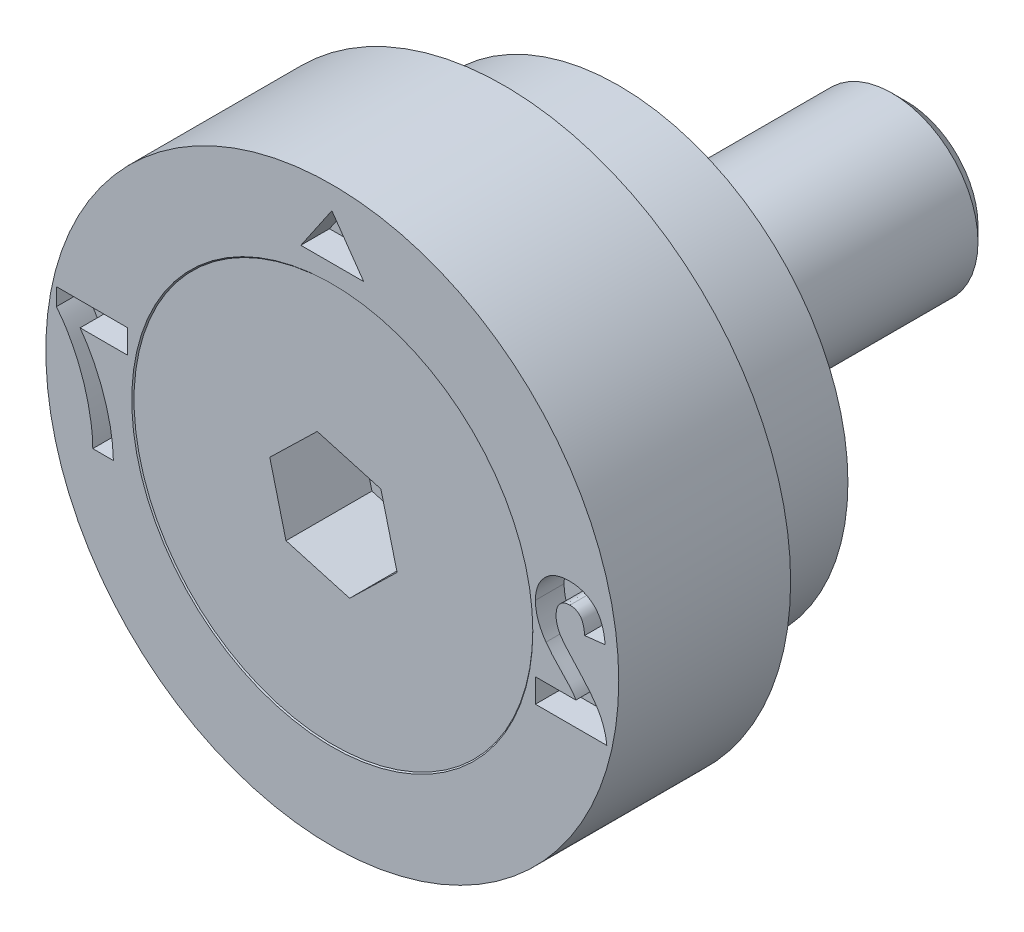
ISO-10303-21;
HEADER;
FILE_DESCRIPTION(('STEP AP214'),'2;1');
FILE_NAME('part.step','',(''),(''),'','','');
FILE_SCHEMA(('AUTOMOTIVE_DESIGN { 1 0 10303 214 1 1 1 1 }'));
ENDSEC;
DATA;
#1=APPLICATION_CONTEXT('core data for automotive mechanical design processes');
#2=APPLICATION_PROTOCOL_DEFINITION('international standard','automotive_design',2000,#1);
#3=PRODUCT_CONTEXT('',#1,'mechanical');
#4=PRODUCT('Part','Part','',(#3));
#5=PRODUCT_RELATED_PRODUCT_CATEGORY('part','',(#4));
#6=PRODUCT_DEFINITION_FORMATION('','',#4);
#7=PRODUCT_DEFINITION_CONTEXT('part definition',#1,'design');
#8=PRODUCT_DEFINITION('design','',#6,#7);
#9=PRODUCT_DEFINITION_SHAPE('','',#8);
#10=(LENGTH_UNIT() NAMED_UNIT(*) SI_UNIT(.MILLI.,.METRE.));
#11=(NAMED_UNIT(*) PLANE_ANGLE_UNIT() SI_UNIT($,.RADIAN.));
#12=(NAMED_UNIT(*) SI_UNIT($,.STERADIAN.) SOLID_ANGLE_UNIT());
#13=UNCERTAINTY_MEASURE_WITH_UNIT(LENGTH_MEASURE(1.E-05),#10,'distance_accuracy_value','');
#14=(GEOMETRIC_REPRESENTATION_CONTEXT(3) GLOBAL_UNCERTAINTY_ASSIGNED_CONTEXT((#13)) GLOBAL_UNIT_ASSIGNED_CONTEXT((#10,
#11,#12)) REPRESENTATION_CONTEXT('',''));
#15=CARTESIAN_POINT('',(0.,0.,0.));
#16=DIRECTION('',(0.,0.,1.));
#17=DIRECTION('',(1.,0.,0.));
#18=AXIS2_PLACEMENT_3D('',#15,#16,#17);
#19=CARTESIAN_POINT('',(0.,0.,-0.0200000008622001));
#20=DIRECTION('',(0.,0.,1.));
#21=DIRECTION('',(1.,0.,0.));
#22=AXIS2_PLACEMENT_3D('',#19,#20,#21);
#23=CYLINDRICAL_SURFACE('',#22,1.5);
#24=CARTESIAN_POINT('',(0.,0.,-2.0000000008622));
#25=DIRECTION('',(0.,0.,1.));
#26=DIRECTION('',(1.,0.,0.));
#27=AXIS2_PLACEMENT_3D('',#24,#25,#26);
#28=CIRCLE('',#27,1.5);
#29=CARTESIAN_POINT('',(1.5,0.,-2.0000000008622));
#30=VERTEX_POINT('',#29);
#31=EDGE_CURVE('E12',#30,#30,#28,.T.);
#32=ORIENTED_EDGE('',*,*,#31,.F.);
#33=EDGE_LOOP('',(#32));
#34=FACE_BOUND('',#33,.T.);
#35=CARTESIAN_POINT('',(0.,0.,-9.7700000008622));
#36=DIRECTION('',(0.,0.,1.));
#37=DIRECTION('',(1.,0.,0.));
#38=AXIS2_PLACEMENT_3D('',#35,#36,#37);
#39=CIRCLE('',#38,1.5);
#40=CARTESIAN_POINT('',(1.5,0.,-9.7700000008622));
#41=VERTEX_POINT('',#40);
#42=EDGE_CURVE('E152',#41,#41,#39,.T.);
#43=ORIENTED_EDGE('',*,*,#42,.T.);
#44=EDGE_LOOP('',(#43));
#45=FACE_BOUND('',#44,.T.);
#46=ADVANCED_FACE('F51',(#34,#45),#23,.T.);
#47=CARTESIAN_POINT('',(0.,0.,-2.0000000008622));
#48=DIRECTION('',(0.,0.,1.));
#49=DIRECTION('',(1.,0.,0.));
#50=AXIS2_PLACEMENT_3D('',#47,#48,#49);
#51=CONICAL_SURFACE('',#50,1.5,0.785398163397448);
#52=CARTESIAN_POINT('',(0.,0.,-0.0200000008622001));
#53=DIRECTION('',(0.,0.,1.));
#54=DIRECTION('',(1.,0.,0.));
#55=AXIS2_PLACEMENT_3D('',#52,#53,#54);
#56=CIRCLE('',#55,3.48);
#57=CARTESIAN_POINT('',(3.48,0.,-0.0200000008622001));
#58=VERTEX_POINT('',#57);
#59=EDGE_CURVE('E58',#58,#58,#56,.T.);
#60=ORIENTED_EDGE('',*,*,#59,.F.);
#61=EDGE_LOOP('',(#60));
#62=FACE_BOUND('',#61,.T.);
#63=ORIENTED_EDGE('',*,*,#31,.T.);
#64=EDGE_LOOP('',(#63));
#65=FACE_BOUND('',#64,.T.);
#66=ADVANCED_FACE('F167',(#62,#65),#51,.T.);
#67=CARTESIAN_POINT('',(0.,3.48,-0.0200000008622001));
#68=DIRECTION('',(0.,0.,-1.));
#69=DIRECTION('',(-1.,0.,0.));
#70=AXIS2_PLACEMENT_3D('',#67,#68,#69);
#71=PLANE('',#70);
#72=DIRECTION('',(0.962144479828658,-0.272539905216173,0.));
#73=VECTOR('',#72,1.);
#74=CARTESIAN_POINT('',(-0.828034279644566,-0.804793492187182,-0.0200000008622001));
#75=LINE('',#74,#73);
#76=CARTESIAN_POINT('',(-0.828034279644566,-0.804793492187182,-0.0200000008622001));
#77=VERTEX_POINT('',#76);
#78=CARTESIAN_POINT('',(0.282954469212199,-1.11949546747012,-0.0200000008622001));
#79=VERTEX_POINT('',#78);
#80=EDGE_CURVE('E139',#77,#79,#75,.T.);
#81=ORIENTED_EDGE('',*,*,#80,.F.);
#82=DIRECTION('',(0.245045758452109,-0.969511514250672,0.));
#83=VECTOR('',#82,1.);
#84=CARTESIAN_POINT('',(-1.11098874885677,0.314701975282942,-0.0200000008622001));
#85=LINE('',#84,#83);
#86=CARTESIAN_POINT('',(-1.11098874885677,0.314701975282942,-0.0200000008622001));
#87=VERTEX_POINT('',#86);
#88=EDGE_CURVE('E65',#87,#77,#85,.T.);
#89=ORIENTED_EDGE('',*,*,#88,.F.);
#90=DIRECTION('',(-0.717098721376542,-0.696971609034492,0.));
#91=VECTOR('',#90,1.);
#92=CARTESIAN_POINT('',(-0.282954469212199,1.11949546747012,-0.0200000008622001));
#93=LINE('',#92,#91);
#94=CARTESIAN_POINT('',(-0.282954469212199,1.11949546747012,-0.0200000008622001));
#95=VERTEX_POINT('',#94);
#96=EDGE_CURVE('E148',#95,#87,#93,.T.);
#97=ORIENTED_EDGE('',*,*,#96,.F.);
#98=DIRECTION('',(-0.962144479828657,0.272539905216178,0.));
#99=VECTOR('',#98,1.);
#100=CARTESIAN_POINT('',(0.828034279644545,0.804793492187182,-0.0200000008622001));
#101=LINE('',#100,#99);
#102=CARTESIAN_POINT('',(0.828034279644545,0.804793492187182,-0.0200000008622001));
#103=VERTEX_POINT('',#102);
#104=EDGE_CURVE('E146',#103,#95,#101,.T.);
#105=ORIENTED_EDGE('',*,*,#104,.F.);
#106=DIRECTION('',(-0.245045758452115,0.96951151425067,0.));
#107=VECTOR('',#106,1.);
#108=CARTESIAN_POINT('',(1.11098874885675,-0.314701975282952,-0.0200000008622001));
#109=LINE('',#108,#107);
#110=CARTESIAN_POINT('',(1.11098874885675,-0.314701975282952,-0.0200000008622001));
#111=VERTEX_POINT('',#110);
#112=EDGE_CURVE('E113',#111,#103,#109,.T.);
#113=ORIENTED_EDGE('',*,*,#112,.F.);
#114=DIRECTION('',(0.717098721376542,0.696971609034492,0.));
#115=VECTOR('',#114,1.);
#116=CARTESIAN_POINT('',(0.282954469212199,-1.11949546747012,-0.0200000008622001));
#117=LINE('',#116,#115);
#118=EDGE_CURVE('E142',#79,#111,#117,.T.);
#119=ORIENTED_EDGE('',*,*,#118,.F.);
#120=EDGE_LOOP('',(#81,#89,#97,#105,#113,#119));
#121=FACE_BOUND('',#120,.T.);
#122=ORIENTED_EDGE('',*,*,#59,.T.);
#123=EDGE_LOOP('',(#122));
#124=FACE_BOUND('',#123,.T.);
#125=ADVANCED_FACE('F165',(#121,#124),#71,.F.);
#126=CARTESIAN_POINT('',(0.,0.,-10.0200000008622));
#127=DIRECTION('',(0.,0.,1.));
#128=DIRECTION('',(1.,0.,0.));
#129=AXIS2_PLACEMENT_3D('',#126,#127,#128);
#130=PLANE('',#129);
#131=CARTESIAN_POINT('',(0.,0.,-10.0200000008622));
#132=DIRECTION('',(0.,0.,1.));
#133=DIRECTION('',(1.,0.,0.));
#134=AXIS2_PLACEMENT_3D('',#131,#132,#133);
#135=CIRCLE('',#134,1.25);
#136=CARTESIAN_POINT('',(1.25,0.,-10.0200000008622));
#137=VERTEX_POINT('',#136);
#138=EDGE_CURVE('E160',#137,#137,#135,.T.);
#139=ORIENTED_EDGE('',*,*,#138,.F.);
#140=EDGE_LOOP('',(#139));
#141=FACE_BOUND('',#140,.T.);
#142=ADVANCED_FACE('F180',(#141),#130,.F.);
#143=CARTESIAN_POINT('',(0.,0.,-10.0200000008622));
#144=DIRECTION('',(0.,0.,1.));
#145=DIRECTION('',(1.,0.,0.));
#146=AXIS2_PLACEMENT_3D('',#143,#144,#145);
#147=CONICAL_SURFACE('',#146,1.25,0.78539816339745);
#148=ORIENTED_EDGE('',*,*,#42,.F.);
#149=EDGE_LOOP('',(#148));
#150=FACE_BOUND('',#149,.T.);
#151=ORIENTED_EDGE('',*,*,#138,.T.);
#152=EDGE_LOOP('',(#151));
#153=FACE_BOUND('',#152,.T.);
#154=ADVANCED_FACE('F176',(#150,#153),#147,.T.);
#155=CARTESIAN_POINT('',(-1.11098874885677,0.314701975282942,-1.5200000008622));
#156=DIRECTION('',(-0.969511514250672,-0.245045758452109,0.));
#157=DIRECTION('',(0.245045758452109,-0.969511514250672,0.));
#158=AXIS2_PLACEMENT_3D('',#155,#156,#157);
#159=PLANE('',#158);
#160=ORIENTED_EDGE('',*,*,#88,.T.);
#161=DIRECTION('',(0.,0.,1.));
#162=VECTOR('',#161,1.);
#163=CARTESIAN_POINT('',(-0.828034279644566,-0.804793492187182,-1.5200000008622));
#164=LINE('',#163,#162);
#165=CARTESIAN_POINT('',(-0.828034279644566,-0.804793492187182,-1.5200000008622));
#166=VERTEX_POINT('',#165);
#167=EDGE_CURVE('E95',#166,#77,#164,.T.);
#168=ORIENTED_EDGE('',*,*,#167,.F.);
#169=DIRECTION('',(0.245045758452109,-0.969511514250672,0.));
#170=VECTOR('',#169,1.);
#171=CARTESIAN_POINT('',(-1.11098874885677,0.314701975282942,-1.5200000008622));
#172=LINE('',#171,#170);
#173=CARTESIAN_POINT('',(-1.11098874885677,0.314701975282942,-1.5200000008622));
#174=VERTEX_POINT('',#173);
#175=EDGE_CURVE('E150',#174,#166,#172,.T.);
#176=ORIENTED_EDGE('',*,*,#175,.F.);
#177=DIRECTION('',(0.,0.,1.));
#178=VECTOR('',#177,1.);
#179=CARTESIAN_POINT('',(-1.11098874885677,0.314701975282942,-1.5200000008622));
#180=LINE('',#179,#178);
#181=EDGE_CURVE('E73',#174,#87,#180,.T.);
#182=ORIENTED_EDGE('',*,*,#181,.T.);
#183=EDGE_LOOP('',(#160,#168,#176,#182));
#184=FACE_BOUND('',#183,.T.);
#185=ADVANCED_FACE('F179',(#184),#159,.F.);
#186=CARTESIAN_POINT('',(-0.282954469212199,1.11949546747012,-1.5200000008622));
#187=DIRECTION('',(-0.696971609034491,0.717098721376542,0.));
#188=DIRECTION('',(-0.717098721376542,-0.696971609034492,0.));
#189=AXIS2_PLACEMENT_3D('',#186,#187,#188);
#190=PLANE('',#189);
#191=ORIENTED_EDGE('',*,*,#96,.T.);
#192=ORIENTED_EDGE('',*,*,#181,.F.);
#193=DIRECTION('',(-0.717098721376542,-0.696971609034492,0.));
#194=VECTOR('',#193,1.);
#195=CARTESIAN_POINT('',(-0.282954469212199,1.11949546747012,-1.5200000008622));
#196=LINE('',#195,#194);
#197=CARTESIAN_POINT('',(-0.282954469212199,1.11949546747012,-1.5200000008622));
#198=VERTEX_POINT('',#197);
#199=EDGE_CURVE('E125',#198,#174,#196,.T.);
#200=ORIENTED_EDGE('',*,*,#199,.F.);
#201=DIRECTION('',(0.,0.,1.));
#202=VECTOR('',#201,1.);
#203=CARTESIAN_POINT('',(-0.282954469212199,1.11949546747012,-1.5200000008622));
#204=LINE('',#203,#202);
#205=EDGE_CURVE('E117',#198,#95,#204,.T.);
#206=ORIENTED_EDGE('',*,*,#205,.T.);
#207=EDGE_LOOP('',(#191,#192,#200,#206));
#208=FACE_BOUND('',#207,.T.);
#209=ADVANCED_FACE('F194',(#208),#190,.F.);
#210=CARTESIAN_POINT('',(0.828034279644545,0.804793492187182,-1.5200000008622));
#211=DIRECTION('',(0.272539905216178,0.962144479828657,0.));
#212=DIRECTION('',(-0.962144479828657,0.272539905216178,0.));
#213=AXIS2_PLACEMENT_3D('',#210,#211,#212);
#214=PLANE('',#213);
#215=ORIENTED_EDGE('',*,*,#104,.T.);
#216=ORIENTED_EDGE('',*,*,#205,.F.);
#217=DIRECTION('',(-0.962144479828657,0.272539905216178,0.));
#218=VECTOR('',#217,1.);
#219=CARTESIAN_POINT('',(0.828034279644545,0.804793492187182,-1.5200000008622));
#220=LINE('',#219,#218);
#221=CARTESIAN_POINT('',(0.828034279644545,0.804793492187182,-1.5200000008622));
#222=VERTEX_POINT('',#221);
#223=EDGE_CURVE('E121',#222,#198,#220,.T.);
#224=ORIENTED_EDGE('',*,*,#223,.F.);
#225=DIRECTION('',(0.,0.,1.));
#226=VECTOR('',#225,1.);
#227=CARTESIAN_POINT('',(0.828034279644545,0.804793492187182,-1.5200000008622));
#228=LINE('',#227,#226);
#229=EDGE_CURVE('E106',#222,#103,#228,.T.);
#230=ORIENTED_EDGE('',*,*,#229,.T.);
#231=EDGE_LOOP('',(#215,#216,#224,#230));
#232=FACE_BOUND('',#231,.T.);
#233=ADVANCED_FACE('F122',(#232),#214,.F.);
#234=CARTESIAN_POINT('',(1.11098874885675,-0.314701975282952,-1.5200000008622));
#235=DIRECTION('',(0.96951151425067,0.245045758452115,0.));
#236=DIRECTION('',(-0.245045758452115,0.96951151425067,0.));
#237=AXIS2_PLACEMENT_3D('',#234,#235,#236);
#238=PLANE('',#237);
#239=ORIENTED_EDGE('',*,*,#112,.T.);
#240=ORIENTED_EDGE('',*,*,#229,.F.);
#241=DIRECTION('',(-0.245045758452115,0.96951151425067,0.));
#242=VECTOR('',#241,1.);
#243=CARTESIAN_POINT('',(1.11098874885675,-0.314701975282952,-1.5200000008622));
#244=LINE('',#243,#242);
#245=CARTESIAN_POINT('',(1.11098874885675,-0.314701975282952,-1.5200000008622));
#246=VERTEX_POINT('',#245);
#247=EDGE_CURVE('E110',#246,#222,#244,.T.);
#248=ORIENTED_EDGE('',*,*,#247,.F.);
#249=DIRECTION('',(0.,0.,1.));
#250=VECTOR('',#249,1.);
#251=CARTESIAN_POINT('',(1.11098874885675,-0.314701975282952,-1.5200000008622));
#252=LINE('',#251,#250);
#253=EDGE_CURVE('E118',#246,#111,#252,.T.);
#254=ORIENTED_EDGE('',*,*,#253,.T.);
#255=EDGE_LOOP('',(#239,#240,#248,#254));
#256=FACE_BOUND('',#255,.T.);
#257=ADVANCED_FACE('F108',(#256),#238,.F.);
#258=CARTESIAN_POINT('',(0.282954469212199,-1.11949546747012,-1.5200000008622));
#259=DIRECTION('',(0.696971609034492,-0.717098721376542,0.));
#260=DIRECTION('',(0.717098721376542,0.696971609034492,0.));
#261=AXIS2_PLACEMENT_3D('',#258,#259,#260);
#262=PLANE('',#261);
#263=ORIENTED_EDGE('',*,*,#118,.T.);
#264=ORIENTED_EDGE('',*,*,#253,.F.);
#265=DIRECTION('',(0.717098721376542,0.696971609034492,0.));
#266=VECTOR('',#265,1.);
#267=CARTESIAN_POINT('',(0.282954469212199,-1.11949546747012,-1.5200000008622));
#268=LINE('',#267,#266);
#269=CARTESIAN_POINT('',(0.282954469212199,-1.11949546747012,-1.5200000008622));
#270=VERTEX_POINT('',#269);
#271=EDGE_CURVE('E131',#270,#246,#268,.T.);
#272=ORIENTED_EDGE('',*,*,#271,.F.);
#273=DIRECTION('',(0.,0.,1.));
#274=VECTOR('',#273,1.);
#275=CARTESIAN_POINT('',(0.282954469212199,-1.11949546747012,-1.5200000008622));
#276=LINE('',#275,#274);
#277=EDGE_CURVE('E155',#270,#79,#276,.T.);
#278=ORIENTED_EDGE('',*,*,#277,.T.);
#279=EDGE_LOOP('',(#263,#264,#272,#278));
#280=FACE_BOUND('',#279,.T.);
#281=ADVANCED_FACE('F198',(#280),#262,.F.);
#282=CARTESIAN_POINT('',(-0.828034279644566,-0.804793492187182,-1.5200000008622));
#283=DIRECTION('',(-0.272539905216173,-0.962144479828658,0.));
#284=DIRECTION('',(0.962144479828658,-0.272539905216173,0.));
#285=AXIS2_PLACEMENT_3D('',#282,#283,#284);
#286=PLANE('',#285);
#287=ORIENTED_EDGE('',*,*,#80,.T.);
#288=ORIENTED_EDGE('',*,*,#277,.F.);
#289=DIRECTION('',(0.962144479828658,-0.272539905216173,0.));
#290=VECTOR('',#289,1.);
#291=CARTESIAN_POINT('',(-0.828034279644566,-0.804793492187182,-1.5200000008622));
#292=LINE('',#291,#290);
#293=EDGE_CURVE('E133',#166,#270,#292,.T.);
#294=ORIENTED_EDGE('',*,*,#293,.F.);
#295=ORIENTED_EDGE('',*,*,#167,.T.);
#296=EDGE_LOOP('',(#287,#288,#294,#295));
#297=FACE_BOUND('',#296,.T.);
#298=ADVANCED_FACE('F195',(#297),#286,.F.);
#299=CARTESIAN_POINT('',(0.,0.,-1.5200000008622));
#300=DIRECTION('',(0.,0.,1.));
#301=DIRECTION('',(1.,0.,0.));
#302=AXIS2_PLACEMENT_3D('',#299,#300,#301);
#303=PLANE('',#302);
#304=ORIENTED_EDGE('',*,*,#175,.T.);
#305=ORIENTED_EDGE('',*,*,#293,.T.);
#306=ORIENTED_EDGE('',*,*,#271,.T.);
#307=ORIENTED_EDGE('',*,*,#247,.T.);
#308=ORIENTED_EDGE('',*,*,#223,.T.);
#309=ORIENTED_EDGE('',*,*,#199,.T.);
#310=EDGE_LOOP('',(#304,#305,#306,#307,#308,#309));
#311=FACE_BOUND('',#310,.T.);
#312=ADVANCED_FACE('F128',(#311),#303,.T.);
#313=CLOSED_SHELL('',(#46,#66,#125,#142,#154,#185,#209,#233,#257,#281,#298,#312));
#314=MANIFOLD_SOLID_BREP('B2',#313);
#315=CARTESIAN_POINT('',(0.,0.,3.12219627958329));
#316=DIRECTION('',(0.,0.,1.));
#317=DIRECTION('',(1.,0.,0.));
#318=AXIS2_PLACEMENT_3D('',#315,#316,#317);
#319=CYLINDRICAL_SURFACE('',#318,5.);
#320=CARTESIAN_POINT('',(0.,0.,0.));
#321=DIRECTION('',(0.,0.,1.));
#322=DIRECTION('',(1.,0.,0.));
#323=AXIS2_PLACEMENT_3D('',#320,#321,#322);
#324=CIRCLE('',#323,5.);
#325=CARTESIAN_POINT('',(5.,0.,0.));
#326=VERTEX_POINT('',#325);
#327=EDGE_CURVE('E49',#326,#326,#324,.T.);
#328=ORIENTED_EDGE('',*,*,#327,.F.);
#329=EDGE_LOOP('',(#328));
#330=FACE_BOUND('',#329,.T.);
#331=CARTESIAN_POINT('',(0.,0.,-3.));
#332=DIRECTION('',(0.,0.,1.));
#333=DIRECTION('',(1.,0.,0.));
#334=AXIS2_PLACEMENT_3D('',#331,#332,#333);
#335=CIRCLE('',#334,5.);
#336=CARTESIAN_POINT('',(5.,0.,-3.));
#337=VERTEX_POINT('',#336);
#338=EDGE_CURVE('E613',#337,#337,#335,.T.);
#339=ORIENTED_EDGE('',*,*,#338,.T.);
#340=EDGE_LOOP('',(#339));
#341=FACE_BOUND('',#340,.T.);
#342=ADVANCED_FACE('F310',(#330,#341),#319,.T.);
#343=CARTESIAN_POINT('',(0.,5.,0.));
#344=DIRECTION('',(0.,0.,-1.));
#345=DIRECTION('',(-1.,0.,0.));
#346=AXIS2_PLACEMENT_3D('',#343,#344,#345);
#347=PLANE('',#346);
#348=DIRECTION('',(0.,-1.,0.));
#349=VECTOR('',#348,1.);
#350=CARTESIAN_POINT('',(3.54590512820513,-0.664307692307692,0.));
#351=LINE('',#350,#349);
#352=CARTESIAN_POINT('',(3.54590512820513,-0.664307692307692,0.));
#353=VERTEX_POINT('',#352);
#354=CARTESIAN_POINT('',(3.54590512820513,-1.0795,0.));
#355=VERTEX_POINT('',#354);
#356=EDGE_CURVE('E822',#353,#355,#351,.T.);
#357=ORIENTED_EDGE('',*,*,#356,.F.);
#358=DIRECTION('',(-1.,0.,0.));
#359=VECTOR('',#358,1.);
#360=CARTESIAN_POINT('',(4.25129955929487,-0.664307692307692,0.));
#361=LINE('',#360,#359);
#362=CARTESIAN_POINT('',(4.25129955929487,-0.664307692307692,0.));
#363=VERTEX_POINT('',#362);
#364=EDGE_CURVE('E324',#363,#353,#361,.T.);
#365=ORIENTED_EDGE('',*,*,#364,.F.);
#366=CARTESIAN_POINT('',(3.72928173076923,-0.0493040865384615,0.));
#367=CARTESIAN_POINT('',(3.73495702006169,-0.0575885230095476,0.));
#368=CARTESIAN_POINT('',(3.74713707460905,-0.0753682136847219,0.));
#369=CARTESIAN_POINT('',(3.76857080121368,-0.102241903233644,0.));
#370=CARTESIAN_POINT('',(3.79272897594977,-0.132254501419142,0.));
#371=CARTESIAN_POINT('',(3.82047705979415,-0.164654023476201,0.));
#372=CARTESIAN_POINT('',(3.8516914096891,-0.199493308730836,0.));
#373=CARTESIAN_POINT('',(3.88566781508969,-0.237429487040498,0.));
#374=CARTESIAN_POINT('',(3.92413300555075,-0.276858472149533,0.));
#375=CARTESIAN_POINT('',(3.96379371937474,-0.318778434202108,0.));
#376=CARTESIAN_POINT('',(4.00411888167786,-0.359207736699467,0.));
#377=CARTESIAN_POINT('',(4.04066877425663,-0.397899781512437,0.));
#378=CARTESIAN_POINT('',(4.07374382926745,-0.432449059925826,0.));
#379=CARTESIAN_POINT('',(4.10259897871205,-0.46356105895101,0.));
#380=CARTESIAN_POINT('',(4.12765750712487,-0.490831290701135,0.));
#381=CARTESIAN_POINT('',(4.14903626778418,-0.514038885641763,0.));
#382=CARTESIAN_POINT('',(4.16599827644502,-0.534002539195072,0.));
#383=CARTESIAN_POINT('',(4.18993262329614,-0.564473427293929,0.));
#384=CARTESIAN_POINT('',(4.22005774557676,-0.606317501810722,0.));
#385=CARTESIAN_POINT('',(4.24115605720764,-0.645479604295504,0.));
#386=CARTESIAN_POINT('',(4.25129955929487,-0.664307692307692,0.));
#387=B_SPLINE_CURVE_WITH_KNOTS('',3,(#366,#367,#368,#369,#370,#371,#372,#373,#374,#375,#376,
#377,#378,#379,#380,#381,#382,#383,#384,#385,#386),.UNSPECIFIED.,.F.,.F.,(4,1,1,1,1,1,1,1,1,1,1,
1,1,1,1,1,1,1,4),(0.,0.0372293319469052,0.0798999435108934,0.127410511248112,0.180123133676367,
0.238064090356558,0.30089248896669,0.368957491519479,0.442313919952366,0.514902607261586,
0.580699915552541,0.639694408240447,0.692276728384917,0.738059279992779,0.777043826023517,
0.809286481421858,0.835170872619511,0.920754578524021,1.),.UNSPECIFIED.);
#388=CARTESIAN_POINT('',(3.72928173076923,-0.0493040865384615,0.));
#389=VERTEX_POINT('',#388);
#390=EDGE_CURVE('E485',#389,#363,#387,.T.);
#391=ORIENTED_EDGE('',*,*,#390,.F.);
#392=CARTESIAN_POINT('',(3.54590512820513,0.492175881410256,0.));
#393=CARTESIAN_POINT('',(3.54636144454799,0.468652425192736,0.));
#394=CARTESIAN_POINT('',(3.54726574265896,0.422035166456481,0.));
#395=CARTESIAN_POINT('',(3.55578515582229,0.353026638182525,0.));
#396=CARTESIAN_POINT('',(3.56952147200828,0.28572181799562,0.));
#397=CARTESIAN_POINT('',(3.58941862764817,0.219724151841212,0.));
#398=CARTESIAN_POINT('',(3.61470659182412,0.153730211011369,0.));
#399=CARTESIAN_POINT('',(3.64670046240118,0.0869824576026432,0.));
#400=CARTESIAN_POINT('',(3.6846299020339,0.0185238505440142,0.));
#401=CARTESIAN_POINT('',(3.71412621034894,-0.0262822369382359,0.));
#402=CARTESIAN_POINT('',(3.72928173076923,-0.0493040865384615,0.));
#403=B_SPLINE_CURVE_WITH_KNOTS('',3,(#392,#393,#394,#395,#396,#397,#398,#399,#400,#401,#402),
.UNSPECIFIED.,.F.,.F.,(4,1,1,1,1,1,1,1,4),(0.,0.121430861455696,0.240643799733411,
0.358470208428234,0.475770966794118,0.596193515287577,0.723070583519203,0.857710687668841,1.),.UNSPECIFIED.);
#404=CARTESIAN_POINT('',(3.54590512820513,0.492175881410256,0.));
#405=VERTEX_POINT('',#404);
#406=EDGE_CURVE('E488',#405,#389,#403,.T.);
#407=ORIENTED_EDGE('',*,*,#406,.F.);
#408=CARTESIAN_POINT('',(4.14058161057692,1.0795,0.));
#409=CARTESIAN_POINT('',(4.11807179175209,1.0790159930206,0.));
#410=CARTESIAN_POINT('',(4.07420815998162,1.07807283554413,0.));
#411=CARTESIAN_POINT('',(4.0101485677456,1.07031647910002,0.));
#412=CARTESIAN_POINT('',(3.9499007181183,1.05665872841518,0.));
#413=CARTESIAN_POINT('',(3.89293876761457,1.03897597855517,0.));
#414=CARTESIAN_POINT('',(3.84018317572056,1.01471131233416,0.));
#415=CARTESIAN_POINT('',(3.79083577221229,0.985702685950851,0.));
#416=CARTESIAN_POINT('',(3.7454673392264,0.950914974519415,0.));
#417=CARTESIAN_POINT('',(3.70394646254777,0.911550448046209,0.));
#418=CARTESIAN_POINT('',(3.66695414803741,0.868328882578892,0.));
#419=CARTESIAN_POINT('',(3.63426850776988,0.822434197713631,0.));
#420=CARTESIAN_POINT('',(3.60685929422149,0.773725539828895,0.));
#421=CARTESIAN_POINT('',(3.58477841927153,0.722333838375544,0.));
#422=CARTESIAN_POINT('',(3.56744484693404,0.668456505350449,0.));
#423=CARTESIAN_POINT('',(3.55484224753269,0.612024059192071,0.));
#424=CARTESIAN_POINT('',(3.54744971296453,0.552921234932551,0.));
#425=CARTESIAN_POINT('',(3.54642618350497,0.512667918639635,0.));
#426=CARTESIAN_POINT('',(3.54590512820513,0.492175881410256,0.));
#427=B_SPLINE_CURVE_WITH_KNOTS('',3,(#408,#409,#410,#411,#412,#413,#414,#415,#416,#417,#418,
#419,#420,#421,#422,#423,#424,#425,#426),.UNSPECIFIED.,.F.,.F.,(4,1,1,1,1,1,1,1,1,1,1,1,1,1,1,1,
4),(0.,0.0718026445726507,0.139917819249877,0.205419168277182,0.268691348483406,
0.329822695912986,0.390243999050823,0.450956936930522,0.511795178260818,0.572457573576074,
0.632179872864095,0.69128264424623,0.750406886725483,0.81033250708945,0.871593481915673,
0.934631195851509,1.),.UNSPECIFIED.);
#428=CARTESIAN_POINT('',(4.14058161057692,1.0795,0.));
#429=VERTEX_POINT('',#428);
#430=EDGE_CURVE('E757',#429,#405,#427,.T.);
#431=ORIENTED_EDGE('',*,*,#430,.F.);
#432=CARTESIAN_POINT('',(4.76380256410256,0.428167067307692,0.));
#433=CARTESIAN_POINT('',(4.76091261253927,0.456195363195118,0.));
#434=CARTESIAN_POINT('',(4.75531282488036,0.510505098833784,0.));
#435=CARTESIAN_POINT('',(4.74020726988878,0.588427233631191,0.));
#436=CARTESIAN_POINT('',(4.72207189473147,0.660439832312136,0.));
#437=CARTESIAN_POINT('',(4.69897073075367,0.726256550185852,0.));
#438=CARTESIAN_POINT('',(4.6720197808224,0.786137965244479,0.));
#439=CARTESIAN_POINT('',(4.64033428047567,0.839625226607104,0.));
#440=CARTESIAN_POINT('',(4.60456496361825,0.887142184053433,0.));
#441=CARTESIAN_POINT('',(4.56418022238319,0.928272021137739,0.));
#442=CARTESIAN_POINT('',(4.52000154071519,0.963638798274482,0.));
#443=CARTESIAN_POINT('',(4.47383982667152,0.995113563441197,0.));
#444=CARTESIAN_POINT('',(4.42457376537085,1.02112544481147,0.));
#445=CARTESIAN_POINT('',(4.37278599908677,1.04225059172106,0.));
#446=CARTESIAN_POINT('',(4.3186382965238,1.05945401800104,0.));
#447=CARTESIAN_POINT('',(4.26146497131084,1.07073256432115,0.));
#448=CARTESIAN_POINT('',(4.20192387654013,1.0785478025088,0.));
#449=CARTESIAN_POINT('',(4.16122350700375,1.07917958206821,0.));
#450=CARTESIAN_POINT('',(4.14058161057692,1.0795,0.));
#451=B_SPLINE_CURVE_WITH_KNOTS('',3,(#432,#433,#434,#435,#436,#437,#438,#439,#440,#441,#442,
#443,#444,#445,#446,#447,#448,#449,#450),.UNSPECIFIED.,.F.,.F.,(4,1,1,1,1,1,1,1,1,1,1,1,1,1,1,1,
4),(0.,0.0836347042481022,0.162056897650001,0.235468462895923,0.30397920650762,
0.368923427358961,0.430156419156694,0.488208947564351,0.545123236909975,0.600818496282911,
0.656031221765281,0.710804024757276,0.765898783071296,0.821956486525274,0.879217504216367,
0.938743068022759,1.),.UNSPECIFIED.);
#452=CARTESIAN_POINT('',(4.76380256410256,0.428167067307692,0.));
#453=VERTEX_POINT('',#452);
#454=EDGE_CURVE('E765',#453,#429,#451,.T.);
#455=ORIENTED_EDGE('',*,*,#454,.F.);
#456=DIRECTION('',(0.993678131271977,0.112266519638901,0.));
#457=VECTOR('',#456,1.);
#458=CARTESIAN_POINT('',(4.40396923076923,0.38751282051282,0.));
#459=LINE('',#458,#457);
#460=CARTESIAN_POINT('',(4.40396923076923,0.38751282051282,0.));
#461=VERTEX_POINT('',#460);
#462=EDGE_CURVE('E773',#461,#453,#459,.T.);
#463=ORIENTED_EDGE('',*,*,#462,.F.);
#464=CARTESIAN_POINT('',(4.14836646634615,0.719666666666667,0.));
#465=CARTESIAN_POINT('',(4.16619861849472,0.718826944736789,0.));
#466=CARTESIAN_POINT('',(4.2006142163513,0.717206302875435,0.));
#467=CARTESIAN_POINT('',(4.24956105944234,0.702569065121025,0.));
#468=CARTESIAN_POINT('',(4.29245028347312,0.677651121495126,0.));
#469=CARTESIAN_POINT('',(4.32310874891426,0.64935495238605,0.));
#470=CARTESIAN_POINT('',(4.34373644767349,0.621784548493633,0.));
#471=CARTESIAN_POINT('',(4.35756691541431,0.597588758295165,0.));
#472=CARTESIAN_POINT('',(4.37016263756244,0.570483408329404,0.));
#473=CARTESIAN_POINT('',(4.38033883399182,0.539948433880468,0.));
#474=CARTESIAN_POINT('',(4.38903869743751,0.506430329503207,0.));
#475=CARTESIAN_POINT('',(4.39578619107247,0.46970636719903,0.));
#476=CARTESIAN_POINT('',(4.40104547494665,0.429720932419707,0.));
#477=CARTESIAN_POINT('',(4.40296960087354,0.40194374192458,0.));
#478=CARTESIAN_POINT('',(4.40396923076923,0.38751282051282,0.));
#479=B_SPLINE_CURVE_WITH_KNOTS('',3,(#464,#465,#466,#467,#468,#469,#470,#471,#472,#473,#474,
#475,#476,#477,#478),.UNSPECIFIED.,.F.,.F.,(4,1,1,1,1,1,1,1,1,1,1,1,4),(0.,0.113180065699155,
0.218434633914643,0.321087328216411,0.426146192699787,0.481136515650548,0.539455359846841,
0.603018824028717,0.670840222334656,0.743752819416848,0.823023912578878,0.908056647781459,1.),.UNSPECIFIED.);
#480=CARTESIAN_POINT('',(4.14836646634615,0.719666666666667,0.));
#481=VERTEX_POINT('',#480);
#482=EDGE_CURVE('E779',#481,#461,#479,.T.);
#483=ORIENTED_EDGE('',*,*,#482,.F.);
#484=CARTESIAN_POINT('',(3.90573846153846,0.436384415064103,0.));
#485=CARTESIAN_POINT('',(3.9063543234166,0.457927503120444,0.));
#486=CARTESIAN_POINT('',(3.90751883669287,0.498662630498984,0.));
#487=CARTESIAN_POINT('',(3.91964174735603,0.555966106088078,0.));
#488=CARTESIAN_POINT('',(3.94001444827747,0.605377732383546,0.));
#489=CARTESIAN_POINT('',(3.96830805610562,0.647064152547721,0.));
#490=CARTESIAN_POINT('',(4.00456346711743,0.679337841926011,0.));
#491=CARTESIAN_POINT('',(4.0466711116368,0.703835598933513,0.));
#492=CARTESIAN_POINT('',(4.09586169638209,0.716912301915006,0.));
#493=CARTESIAN_POINT('',(4.13042090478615,0.718725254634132,0.));
#494=CARTESIAN_POINT('',(4.14836646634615,0.719666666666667,0.));
#495=B_SPLINE_CURVE_WITH_KNOTS('',3,(#484,#485,#486,#487,#488,#489,#490,#491,#492,#493,#494),
.UNSPECIFIED.,.F.,.F.,(4,1,1,1,1,1,1,1,4),(0.,0.152713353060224,0.288760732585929,
0.413023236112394,0.52994305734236,0.642943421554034,0.754737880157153,0.87264272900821,1.),.UNSPECIFIED.);
#496=CARTESIAN_POINT('',(3.90573846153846,0.436384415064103,0.));
#497=VERTEX_POINT('',#496);
#498=EDGE_CURVE('E784',#497,#481,#495,.T.);
#499=ORIENTED_EDGE('',*,*,#498,.F.);
#500=CARTESIAN_POINT('',(3.97882960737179,0.186836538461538,0.));
#501=CARTESIAN_POINT('',(3.96764516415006,0.207642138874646,0.));
#502=CARTESIAN_POINT('',(3.94597589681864,0.247951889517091,0.));
#503=CARTESIAN_POINT('',(3.92275645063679,0.310981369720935,0.));
#504=CARTESIAN_POINT('',(3.90879838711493,0.373779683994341,0.));
#505=CARTESIAN_POINT('',(3.90674932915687,0.415702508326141,0.));
#506=CARTESIAN_POINT('',(3.90573846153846,0.436384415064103,0.));
#507=B_SPLINE_CURVE_WITH_KNOTS('',3,(#500,#501,#502,#503,#504,#505,#506),.UNSPECIFIED.,.F.,.F.,
(4,1,1,1,4),(0.,0.269282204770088,0.52172003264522,0.764048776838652,1.),.UNSPECIFIED.);
#508=CARTESIAN_POINT('',(3.97882960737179,0.186836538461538,0.));
#509=VERTEX_POINT('',#508);
#510=EDGE_CURVE('E792',#509,#497,#507,.T.);
#511=ORIENTED_EDGE('',*,*,#510,.F.);
#512=CARTESIAN_POINT('',(4.27249166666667,-0.161752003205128,0.));
#513=CARTESIAN_POINT('',(4.25343205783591,-0.141164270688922,0.));
#514=CARTESIAN_POINT('',(4.21717778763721,-0.102003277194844,0.));
#515=CARTESIAN_POINT('',(4.16584537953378,-0.0456234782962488,0.));
#516=CARTESIAN_POINT('',(4.12053193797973,0.00579456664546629,0.));
#517=CARTESIAN_POINT('',(4.08082044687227,0.0518765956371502,0.));
#518=CARTESIAN_POINT('',(4.04676749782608,0.0926941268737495,0.));
#519=CARTESIAN_POINT('',(4.01868585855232,0.128383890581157,0.));
#520=CARTESIAN_POINT('',(3.99633559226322,0.15904648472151,0.));
#521=CARTESIAN_POINT('',(3.98422326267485,0.178274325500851,0.));
#522=CARTESIAN_POINT('',(3.97882960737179,0.186836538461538,0.));
#523=B_SPLINE_CURVE_WITH_KNOTS('',3,(#512,#513,#514,#515,#516,#517,#518,#519,#520,#521,#522),
.UNSPECIFIED.,.F.,.F.,(4,1,1,1,1,1,1,1,4),(0.,0.184436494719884,0.350826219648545,
0.501230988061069,0.634967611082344,0.750729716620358,0.850641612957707,0.933490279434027,1.),.UNSPECIFIED.);
#524=CARTESIAN_POINT('',(4.27249166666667,-0.161752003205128,0.));
#525=VERTEX_POINT('',#524);
#526=EDGE_CURVE('E800',#525,#509,#523,.T.);
#527=ORIENTED_EDGE('',*,*,#526,.F.);
#528=CARTESIAN_POINT('',(4.79148205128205,-1.0795,0.));
#529=CARTESIAN_POINT('',(4.78719712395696,-1.04404631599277,0.));
#530=CARTESIAN_POINT('',(4.77864999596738,-0.973326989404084,0.));
#531=CARTESIAN_POINT('',(4.75224640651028,-0.869792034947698,0.));
#532=CARTESIAN_POINT('',(4.71734264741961,-0.768685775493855,0.));
#533=CARTESIAN_POINT('',(4.67897002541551,-0.686507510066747,0.));
#534=CARTESIAN_POINT('',(4.64170417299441,-0.619669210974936,0.));
#535=CARTESIAN_POINT('',(4.60678877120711,-0.565795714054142,0.));
#536=CARTESIAN_POINT('',(4.56605985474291,-0.507839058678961,0.));
#537=CARTESIAN_POINT('',(4.51922121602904,-0.446037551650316,0.));
#538=CARTESIAN_POINT('',(4.46637936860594,-0.380322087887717,0.));
#539=CARTESIAN_POINT('',(4.40745032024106,-0.310754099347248,0.));
#540=CARTESIAN_POINT('',(4.34258179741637,-0.237063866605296,0.));
#541=CARTESIAN_POINT('',(4.29640279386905,-0.187444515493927,0.));
#542=CARTESIAN_POINT('',(4.27249166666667,-0.161752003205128,0.));
#543=B_SPLINE_CURVE_WITH_KNOTS('',3,(#528,#529,#530,#531,#532,#533,#534,#535,#536,#537,#538,
#539,#540,#541,#542),.UNSPECIFIED.,.F.,.F.,(4,1,1,1,1,1,1,1,1,1,1,1,4),(0.,0.0994452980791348,
0.198363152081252,0.297103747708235,0.397237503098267,0.450667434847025,0.510300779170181,
0.576071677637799,0.648078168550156,0.72639487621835,0.811079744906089,0.9021785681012,1.),.UNSPECIFIED.);
#544=CARTESIAN_POINT('',(4.79148205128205,-1.0795,0.));
#545=VERTEX_POINT('',#544);
#546=EDGE_CURVE('E808',#545,#525,#543,.T.);
#547=ORIENTED_EDGE('',*,*,#546,.F.);
#548=DIRECTION('',(1.,0.,0.));
#549=VECTOR('',#548,1.);
#550=CARTESIAN_POINT('',(3.54590512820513,-1.0795,0.));
#551=LINE('',#550,#549);
#552=EDGE_CURVE('E816',#355,#545,#551,.T.);
#553=ORIENTED_EDGE('',*,*,#552,.F.);
#554=EDGE_LOOP('',(#357,#365,#391,#407,#431,#455,#463,#483,#499,#511,#527,#547,#553));
#555=FACE_BOUND('',#554,.T.);
#556=DIRECTION('',(0.,1.,0.));
#557=VECTOR('',#556,1.);
#558=CARTESIAN_POINT('',(-3.57104461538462,0.636628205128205,0.));
#559=LINE('',#558,#557);
#560=CARTESIAN_POINT('',(-3.57104461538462,0.636628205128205,0.));
#561=VERTEX_POINT('',#560);
#562=CARTESIAN_POINT('',(-3.57104461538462,1.05182051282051,0.));
#563=VERTEX_POINT('',#562);
#564=EDGE_CURVE('E550',#561,#563,#559,.T.);
#565=ORIENTED_EDGE('',*,*,#564,.F.);
#566=DIRECTION('',(1.,0.,0.));
#567=VECTOR('',#566,1.);
#568=CARTESIAN_POINT('',(-4.40099673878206,0.636628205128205,0.));
#569=LINE('',#568,#567);
#570=CARTESIAN_POINT('',(-4.40099673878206,0.636628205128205,0.));
#571=VERTEX_POINT('',#570);
#572=EDGE_CURVE('E332',#571,#561,#569,.T.);
#573=ORIENTED_EDGE('',*,*,#572,.F.);
#574=CARTESIAN_POINT('',(-3.82016000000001,-1.0795,0.));
#575=CARTESIAN_POINT('',(-3.82144478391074,-1.04272143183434,0.));
#576=CARTESIAN_POINT('',(-3.82402753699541,-0.968786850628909,0.));
#577=CARTESIAN_POINT('',(-3.83340390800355,-0.857856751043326,0.));
#578=CARTESIAN_POINT('',(-3.84655142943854,-0.746256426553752,0.));
#579=CARTESIAN_POINT('',(-3.86544324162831,-0.634378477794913,0.));
#580=CARTESIAN_POINT('',(-3.88842570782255,-0.521733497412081,0.));
#581=CARTESIAN_POINT('',(-3.91548440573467,-0.408542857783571,0.));
#582=CARTESIAN_POINT('',(-3.94772433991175,-0.294918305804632,0.));
#583=CARTESIAN_POINT('',(-3.98428676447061,-0.181413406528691,0.));
#584=CARTESIAN_POINT('',(-4.02481271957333,-0.0690980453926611,0.));
#585=CARTESIAN_POINT('',(-4.06839638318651,0.0409273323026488,0.));
#586=CARTESIAN_POINT('',(-4.11555450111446,0.14784007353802,0.));
#587=CARTESIAN_POINT('',(-4.16623077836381,0.251617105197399,0.));
#588=CARTESIAN_POINT('',(-4.21985887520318,0.352470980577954,0.));
#589=CARTESIAN_POINT('',(-4.27654753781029,0.450367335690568,0.));
#590=CARTESIAN_POINT('',(-4.33651172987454,0.54530949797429,0.));
#591=CARTESIAN_POINT('',(-4.37954079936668,0.606243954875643,0.));
#592=CARTESIAN_POINT('',(-4.40099673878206,0.636628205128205,0.));
#593=B_SPLINE_CURVE_WITH_KNOTS('',3,(#574,#575,#576,#577,#578,#579,#580,#581,#582,#583,#584,
#585,#586,#587,#588,#589,#590,#591,#592),.UNSPECIFIED.,.F.,.F.,(4,1,1,1,1,1,1,1,1,1,1,1,1,1,1,1,
4),(0.,0.0600673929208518,0.120751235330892,0.181671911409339,0.243459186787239,
0.305905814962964,0.369322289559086,0.433393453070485,0.498664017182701,0.563949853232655,
0.628278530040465,0.691815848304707,0.754651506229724,0.816767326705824,0.878243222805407,
0.939287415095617,1.),.UNSPECIFIED.);
#594=CARTESIAN_POINT('',(-3.82016000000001,-1.0795,0.));
#595=VERTEX_POINT('',#594);
#596=EDGE_CURVE('E570',#595,#571,#593,.T.);
#597=ORIENTED_EDGE('',*,*,#596,.F.);
#598=DIRECTION('',(1.,0.,0.));
#599=VECTOR('',#598,1.);
#600=CARTESIAN_POINT('',(-4.17999333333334,-1.0795,0.));
#601=LINE('',#600,#599);
#602=CARTESIAN_POINT('',(-4.17999333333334,-1.0795,0.));
#603=VERTEX_POINT('',#602);
#604=EDGE_CURVE('E564',#603,#595,#601,.T.);
#605=ORIENTED_EDGE('',*,*,#604,.F.);
#606=CARTESIAN_POINT('',(-4.81662153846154,0.747346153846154,0.));
#607=CARTESIAN_POINT('',(-4.80362185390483,0.73234651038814,0.));
#608=CARTESIAN_POINT('',(-4.77681364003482,0.701413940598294,0.));
#609=CARTESIAN_POINT('',(-4.73871562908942,0.650894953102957,0.));
#610=CARTESIAN_POINT('',(-4.69939554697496,0.596442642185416,0.));
#611=CARTESIAN_POINT('',(-4.66091727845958,0.536602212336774,0.));
#612=CARTESIAN_POINT('',(-4.62134238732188,0.472642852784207,0.));
#613=CARTESIAN_POINT('',(-4.58206008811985,0.403785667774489,0.));
#614=CARTESIAN_POINT('',(-4.5428126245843,0.330099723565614,0.));
#615=CARTESIAN_POINT('',(-4.48965608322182,0.225869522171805,0.));
#616=CARTESIAN_POINT('',(-4.42711768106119,0.0900200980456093,0.));
#617=CARTESIAN_POINT('',(-4.36261851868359,-0.0792866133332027,0.));
#618=CARTESIAN_POINT('',(-4.30596027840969,-0.253027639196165,0.));
#619=CARTESIAN_POINT('',(-4.26793061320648,-0.401281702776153,0.));
#620=CARTESIAN_POINT('',(-4.24215183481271,-0.520085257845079,0.));
#621=CARTESIAN_POINT('',(-4.22529174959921,-0.607038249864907,0.));
#622=CARTESIAN_POINT('',(-4.21072091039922,-0.691483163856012,0.));
#623=CARTESIAN_POINT('',(-4.19981034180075,-0.773770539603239,0.));
#624=CARTESIAN_POINT('',(-4.19029609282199,-0.853594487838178,0.));
#625=CARTESIAN_POINT('',(-4.18464004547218,-0.931098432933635,0.));
#626=CARTESIAN_POINT('',(-4.18018319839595,-1.00606859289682,0.));
#627=CARTESIAN_POINT('',(-4.18005597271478,-1.05527385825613,0.));
#628=CARTESIAN_POINT('',(-4.17999333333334,-1.0795,0.));
#629=B_SPLINE_CURVE_WITH_KNOTS('',3,(#606,#607,#608,#609,#610,#611,#612,#613,#614,#615,#616,
#617,#618,#619,#620,#621,#622,#623,#624,#625,#626,#627,#628),.UNSPECIFIED.,.F.,.F.,(4,1,1,1,1,1,
1,1,1,1,1,1,1,1,1,1,1,1,1,1,4),(0.,0.0302379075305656,0.0623572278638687,0.0963730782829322,
0.132566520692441,0.170733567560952,0.210979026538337,0.253338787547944,0.29794273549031,
0.389265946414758,0.481060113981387,0.573874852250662,0.667598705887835,0.714134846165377,
0.759114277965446,0.802561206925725,0.844689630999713,0.885591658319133,0.92503468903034,
0.963090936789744,1.),.UNSPECIFIED.);
#630=CARTESIAN_POINT('',(-4.81662153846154,0.747346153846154,0.));
#631=VERTEX_POINT('',#630);
#632=EDGE_CURVE('E559',#631,#603,#629,.T.);
#633=ORIENTED_EDGE('',*,*,#632,.F.);
#634=DIRECTION('',(0.,-1.,0.));
#635=VECTOR('',#634,1.);
#636=CARTESIAN_POINT('',(-4.81662153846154,1.05182051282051,0.));
#637=LINE('',#636,#635);
#638=CARTESIAN_POINT('',(-4.81662153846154,1.05182051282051,0.));
#639=VERTEX_POINT('',#638);
#640=EDGE_CURVE('E556',#639,#631,#637,.T.);
#641=ORIENTED_EDGE('',*,*,#640,.F.);
#642=DIRECTION('',(-1.,0.,0.));
#643=VECTOR('',#642,1.);
#644=CARTESIAN_POINT('',(-3.57104461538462,1.05182051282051,0.));
#645=LINE('',#644,#643);
#646=EDGE_CURVE('E553',#563,#639,#645,.T.);
#647=ORIENTED_EDGE('',*,*,#646,.F.);
#648=EDGE_LOOP('',(#565,#573,#597,#605,#633,#641,#647));
#649=FACE_BOUND('',#648,.T.);
#650=DIRECTION('',(-0.573576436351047,0.819152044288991,0.));
#651=VECTOR('',#650,1.);
#652=CARTESIAN_POINT('',(0.548658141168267,3.81,0.));
#653=LINE('',#652,#651);
#654=CARTESIAN_POINT('',(0.548658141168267,3.81,0.));
#655=VERTEX_POINT('',#654);
#656=CARTESIAN_POINT('',(-0.00713159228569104,4.60375,0.));
#657=VERTEX_POINT('',#656);
#658=EDGE_CURVE('E605',#655,#657,#653,.T.);
#659=ORIENTED_EDGE('',*,*,#658,.F.);
#660=DIRECTION('',(1.,0.,0.));
#661=VECTOR('',#660,1.);
#662=CARTESIAN_POINT('',(-0.548658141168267,3.81,0.));
#663=LINE('',#662,#661);
#664=CARTESIAN_POINT('',(-0.548658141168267,3.81,0.));
#665=VERTEX_POINT('',#664);
#666=EDGE_CURVE('E603',#665,#655,#663,.T.);
#667=ORIENTED_EDGE('',*,*,#666,.F.);
#668=DIRECTION('',(-0.563573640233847,-0.826065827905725,0.));
#669=VECTOR('',#668,1.);
#670=CARTESIAN_POINT('',(-0.00713159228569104,4.60375,0.));
#671=LINE('',#670,#669);
#672=EDGE_CURVE('E596',#657,#665,#671,.T.);
#673=ORIENTED_EDGE('',*,*,#672,.F.);
#674=EDGE_LOOP('',(#659,#667,#673));
#675=FACE_BOUND('',#674,.T.);
#676=CARTESIAN_POINT('',(0.,0.,0.));
#677=DIRECTION('',(0.,0.,1.));
#678=DIRECTION('',(1.,0.,0.));
#679=AXIS2_PLACEMENT_3D('',#676,#677,#678);
#680=CIRCLE('',#679,3.5000000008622);
#681=CARTESIAN_POINT('',(3.5000000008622,0.,0.));
#682=VERTEX_POINT('',#681);
#683=EDGE_CURVE('E317',#682,#682,#680,.T.);
#684=ORIENTED_EDGE('',*,*,#683,.F.);
#685=EDGE_LOOP('',(#684));
#686=FACE_BOUND('',#685,.T.);
#687=ORIENTED_EDGE('',*,*,#327,.T.);
#688=EDGE_LOOP('',(#687));
#689=FACE_BOUND('',#688,.T.);
#690=ADVANCED_FACE('F636',(#555,#649,#675,#686,#689),#347,.F.);
#691=CARTESIAN_POINT('',(0.,0.,0.));
#692=DIRECTION('',(0.,0.,1.));
#693=DIRECTION('',(1.,0.,0.));
#694=AXIS2_PLACEMENT_3D('',#691,#692,#693);
#695=CONICAL_SURFACE('',#694,3.5000000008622,0.785398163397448);
#696=CARTESIAN_POINT('',(0.,0.,-2.0000000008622));
#697=DIRECTION('',(0.,0.,1.));
#698=DIRECTION('',(1.,0.,0.));
#699=AXIS2_PLACEMENT_3D('',#696,#697,#698);
#700=CIRCLE('',#699,1.5);
#701=CARTESIAN_POINT('',(1.5,0.,-2.0000000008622));
#702=VERTEX_POINT('',#701);
#703=EDGE_CURVE('E629',#702,#702,#700,.T.);
#704=ORIENTED_EDGE('',*,*,#703,.F.);
#705=EDGE_LOOP('',(#704));
#706=FACE_BOUND('',#705,.T.);
#707=ORIENTED_EDGE('',*,*,#683,.T.);
#708=EDGE_LOOP('',(#707));
#709=FACE_BOUND('',#708,.T.);
#710=ADVANCED_FACE('F634',(#706,#709),#695,.F.);
#711=CARTESIAN_POINT('',(0.,0.,3.12219627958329));
#712=DIRECTION('',(0.,0.,1.));
#713=DIRECTION('',(1.,0.,0.));
#714=AXIS2_PLACEMENT_3D('',#711,#712,#713);
#715=CYLINDRICAL_SURFACE('',#714,1.5);
#716=CARTESIAN_POINT('',(0.,0.,-5.));
#717=DIRECTION('',(0.,0.,1.));
#718=DIRECTION('',(1.,0.,0.));
#719=AXIS2_PLACEMENT_3D('',#716,#717,#718);
#720=CIRCLE('',#719,1.5);
#721=CARTESIAN_POINT('',(1.5,0.,-5.));
#722=VERTEX_POINT('',#721);
#723=EDGE_CURVE('E626',#722,#722,#720,.T.);
#724=ORIENTED_EDGE('',*,*,#723,.F.);
#725=EDGE_LOOP('',(#724));
#726=FACE_BOUND('',#725,.T.);
#727=ORIENTED_EDGE('',*,*,#703,.T.);
#728=EDGE_LOOP('',(#727));
#729=FACE_BOUND('',#728,.T.);
#730=ADVANCED_FACE('F662',(#726,#729),#715,.F.);
#731=CARTESIAN_POINT('',(0.,1.5,-5.));
#732=DIRECTION('',(0.,0.,1.));
#733=DIRECTION('',(1.,0.,0.));
#734=AXIS2_PLACEMENT_3D('',#731,#732,#733);
#735=PLANE('',#734);
#736=CARTESIAN_POINT('',(0.,0.,-5.));
#737=DIRECTION('',(0.,0.,1.));
#738=DIRECTION('',(1.,0.,0.));
#739=AXIS2_PLACEMENT_3D('',#736,#737,#738);
#740=CIRCLE('',#739,4.);
#741=CARTESIAN_POINT('',(4.,0.,-5.));
#742=VERTEX_POINT('',#741);
#743=EDGE_CURVE('E623',#742,#742,#740,.T.);
#744=ORIENTED_EDGE('',*,*,#743,.F.);
#745=EDGE_LOOP('',(#744));
#746=FACE_BOUND('',#745,.T.);
#747=ORIENTED_EDGE('',*,*,#723,.T.);
#748=EDGE_LOOP('',(#747));
#749=FACE_BOUND('',#748,.T.);
#750=ADVANCED_FACE('F656',(#746,#749),#735,.F.);
#751=CARTESIAN_POINT('',(0.,0.,3.12219627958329));
#752=DIRECTION('',(0.,0.,1.));
#753=DIRECTION('',(1.,0.,0.));
#754=AXIS2_PLACEMENT_3D('',#751,#752,#753);
#755=CYLINDRICAL_SURFACE('',#754,4.);
#756=CARTESIAN_POINT('',(0.,0.,-3.));
#757=DIRECTION('',(0.,0.,1.));
#758=DIRECTION('',(1.,0.,0.));
#759=AXIS2_PLACEMENT_3D('',#756,#757,#758);
#760=CIRCLE('',#759,4.);
#761=CARTESIAN_POINT('',(4.,0.,-3.));
#762=VERTEX_POINT('',#761);
#763=EDGE_CURVE('E620',#762,#762,#760,.T.);
#764=ORIENTED_EDGE('',*,*,#763,.F.);
#765=EDGE_LOOP('',(#764));
#766=FACE_BOUND('',#765,.T.);
#767=ORIENTED_EDGE('',*,*,#743,.T.);
#768=EDGE_LOOP('',(#767));
#769=FACE_BOUND('',#768,.T.);
#770=ADVANCED_FACE('F650',(#766,#769),#755,.T.);
#771=CARTESIAN_POINT('',(0.,4.,-3.));
#772=DIRECTION('',(0.,0.,1.));
#773=DIRECTION('',(1.,0.,0.));
#774=AXIS2_PLACEMENT_3D('',#771,#772,#773);
#775=PLANE('',#774);
#776=ORIENTED_EDGE('',*,*,#338,.F.);
#777=EDGE_LOOP('',(#776));
#778=FACE_BOUND('',#777,.T.);
#779=ORIENTED_EDGE('',*,*,#763,.T.);
#780=EDGE_LOOP('',(#779));
#781=FACE_BOUND('',#780,.T.);
#782=ADVANCED_FACE('F646',(#778,#781),#775,.F.);
#783=CARTESIAN_POINT('',(-0.548658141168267,3.81,-0.5));
#784=DIRECTION('',(0.,-1.,0.));
#785=DIRECTION('',(0.,0.,-1.));
#786=AXIS2_PLACEMENT_3D('',#783,#784,#785);
#787=PLANE('',#786);
#788=ORIENTED_EDGE('',*,*,#666,.T.);
#789=DIRECTION('',(0.,0.,1.));
#790=VECTOR('',#789,1.);
#791=CARTESIAN_POINT('',(0.548658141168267,3.81,-0.5));
#792=LINE('',#791,#790);
#793=CARTESIAN_POINT('',(0.548658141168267,3.81,-0.5));
#794=VERTEX_POINT('',#793);
#795=EDGE_CURVE('E602',#794,#655,#792,.T.);
#796=ORIENTED_EDGE('',*,*,#795,.F.);
#797=DIRECTION('',(1.,0.,0.));
#798=VECTOR('',#797,1.);
#799=CARTESIAN_POINT('',(-0.548658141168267,3.81,-0.5));
#800=LINE('',#799,#798);
#801=CARTESIAN_POINT('',(-0.548658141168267,3.81,-0.5));
#802=VERTEX_POINT('',#801);
#803=EDGE_CURVE('E592',#802,#794,#800,.T.);
#804=ORIENTED_EDGE('',*,*,#803,.F.);
#805=DIRECTION('',(0.,0.,1.));
#806=VECTOR('',#805,1.);
#807=CARTESIAN_POINT('',(-0.548658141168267,3.81,-0.5));
#808=LINE('',#807,#806);
#809=EDGE_CURVE('E611',#802,#665,#808,.T.);
#810=ORIENTED_EDGE('',*,*,#809,.T.);
#811=EDGE_LOOP('',(#788,#796,#804,#810));
#812=FACE_BOUND('',#811,.T.);
#813=ADVANCED_FACE('F649',(#812),#787,.F.);
#814=CARTESIAN_POINT('',(-0.00713159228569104,4.60375,-0.5));
#815=DIRECTION('',(-0.826065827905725,0.563573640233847,0.));
#816=DIRECTION('',(-0.563573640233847,-0.826065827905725,0.));
#817=AXIS2_PLACEMENT_3D('',#814,#815,#816);
#818=PLANE('',#817);
#819=ORIENTED_EDGE('',*,*,#672,.T.);
#820=ORIENTED_EDGE('',*,*,#809,.F.);
#821=DIRECTION('',(-0.563573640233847,-0.826065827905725,0.));
#822=VECTOR('',#821,1.);
#823=CARTESIAN_POINT('',(-0.00713159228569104,4.60375,-0.5));
#824=LINE('',#823,#822);
#825=CARTESIAN_POINT('',(-0.00713159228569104,4.60375,-0.5));
#826=VERTEX_POINT('',#825);
#827=EDGE_CURVE('E599',#826,#802,#824,.T.);
#828=ORIENTED_EDGE('',*,*,#827,.F.);
#829=DIRECTION('',(0.,0.,1.));
#830=VECTOR('',#829,1.);
#831=CARTESIAN_POINT('',(-0.00713159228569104,4.60375,-0.5));
#832=LINE('',#831,#830);
#833=EDGE_CURVE('E614',#826,#657,#832,.T.);
#834=ORIENTED_EDGE('',*,*,#833,.T.);
#835=EDGE_LOOP('',(#819,#820,#828,#834));
#836=FACE_BOUND('',#835,.T.);
#837=ADVANCED_FACE('F678',(#836),#818,.F.);
#838=CARTESIAN_POINT('',(0.548658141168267,3.81,-0.5));
#839=DIRECTION('',(0.819152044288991,0.573576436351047,0.));
#840=DIRECTION('',(-0.573576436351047,0.819152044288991,0.));
#841=AXIS2_PLACEMENT_3D('',#838,#839,#840);
#842=PLANE('',#841);
#843=ORIENTED_EDGE('',*,*,#658,.T.);
#844=ORIENTED_EDGE('',*,*,#833,.F.);
#845=DIRECTION('',(-0.573576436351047,0.819152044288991,0.));
#846=VECTOR('',#845,1.);
#847=CARTESIAN_POINT('',(0.548658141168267,3.81,-0.5));
#848=LINE('',#847,#846);
#849=EDGE_CURVE('E595',#794,#826,#848,.T.);
#850=ORIENTED_EDGE('',*,*,#849,.F.);
#851=ORIENTED_EDGE('',*,*,#795,.T.);
#852=EDGE_LOOP('',(#843,#844,#850,#851));
#853=FACE_BOUND('',#852,.T.);
#854=ADVANCED_FACE('F680',(#853),#842,.F.);
#855=CARTESIAN_POINT('',(-0.548658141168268,3.81,-0.5));
#856=DIRECTION('',(0.,0.,-1.));
#857=DIRECTION('',(-1.,0.,0.));
#858=AXIS2_PLACEMENT_3D('',#855,#856,#857);
#859=PLANE('',#858);
#860=ORIENTED_EDGE('',*,*,#803,.T.);
#861=ORIENTED_EDGE('',*,*,#849,.T.);
#862=ORIENTED_EDGE('',*,*,#827,.T.);
#863=EDGE_LOOP('',(#860,#861,#862));
#864=FACE_BOUND('',#863,.T.);
#865=ADVANCED_FACE('F683',(#864),#859,.F.);
#866=CARTESIAN_POINT('',(-4.40099673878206,0.636628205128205,-0.5));
#867=DIRECTION('',(0.,-1.,0.));
#868=DIRECTION('',(0.,0.,-1.));
#869=AXIS2_PLACEMENT_3D('',#866,#867,#868);
#870=PLANE('',#869);
#871=ORIENTED_EDGE('',*,*,#572,.T.);
#872=DIRECTION('',(0.,0.,1.));
#873=VECTOR('',#872,1.);
#874=CARTESIAN_POINT('',(-3.57104461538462,0.636628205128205,-0.5));
#875=LINE('',#874,#873);
#876=CARTESIAN_POINT('',(-3.57104461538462,0.636628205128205,-0.5));
#877=VERTEX_POINT('',#876);
#878=EDGE_CURVE('E543',#877,#561,#875,.T.);
#879=ORIENTED_EDGE('',*,*,#878,.F.);
#880=DIRECTION('',(1.,0.,0.));
#881=VECTOR('',#880,1.);
#882=CARTESIAN_POINT('',(-4.40099673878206,0.636628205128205,-0.5));
#883=LINE('',#882,#881);
#884=CARTESIAN_POINT('',(-4.40099673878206,0.636628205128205,-0.5));
#885=VERTEX_POINT('',#884);
#886=EDGE_CURVE('E575',#885,#877,#883,.T.);
#887=ORIENTED_EDGE('',*,*,#886,.F.);
#888=DIRECTION('',(0.,0.,1.));
#889=VECTOR('',#888,1.);
#890=CARTESIAN_POINT('',(-4.40099673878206,0.636628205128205,-0.5));
#891=LINE('',#890,#889);
#892=EDGE_CURVE('E576',#885,#571,#891,.T.);
#893=ORIENTED_EDGE('',*,*,#892,.T.);
#894=EDGE_LOOP('',(#871,#879,#887,#893));
#895=FACE_BOUND('',#894,.T.);
#896=ADVANCED_FACE('F533',(#895),#870,.F.);
#897=CARTESIAN_POINT('',(-3.82016000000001,-1.0795,-0.5));
#898=CARTESIAN_POINT('',(-3.82144478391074,-1.04272143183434,-0.5));
#899=CARTESIAN_POINT('',(-3.82402753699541,-0.968786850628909,-0.5));
#900=CARTESIAN_POINT('',(-3.83340390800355,-0.857856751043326,-0.5));
#901=CARTESIAN_POINT('',(-3.84655142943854,-0.746256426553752,-0.5));
#902=CARTESIAN_POINT('',(-3.86544324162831,-0.634378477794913,-0.5));
#903=CARTESIAN_POINT('',(-3.88842570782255,-0.521733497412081,-0.5));
#904=CARTESIAN_POINT('',(-3.91548440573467,-0.408542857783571,-0.5));
#905=CARTESIAN_POINT('',(-3.94772433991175,-0.294918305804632,-0.5));
#906=CARTESIAN_POINT('',(-3.98428676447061,-0.181413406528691,-0.5));
#907=CARTESIAN_POINT('',(-4.02481271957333,-0.0690980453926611,-0.5));
#908=CARTESIAN_POINT('',(-4.06839638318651,0.0409273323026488,-0.5));
#909=CARTESIAN_POINT('',(-4.11555450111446,0.14784007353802,-0.5));
#910=CARTESIAN_POINT('',(-4.16623077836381,0.251617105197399,-0.5));
#911=CARTESIAN_POINT('',(-4.21985887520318,0.352470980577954,-0.5));
#912=CARTESIAN_POINT('',(-4.27654753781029,0.450367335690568,-0.5));
#913=CARTESIAN_POINT('',(-4.33651172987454,0.54530949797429,-0.5));
#914=CARTESIAN_POINT('',(-4.37954079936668,0.606243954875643,-0.5));
#915=CARTESIAN_POINT('',(-4.40099673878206,0.636628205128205,-0.5));
#916=B_SPLINE_CURVE_WITH_KNOTS('',3,(#897,#898,#899,#900,#901,#902,#903,#904,#905,#906,#907,
#908,#909,#910,#911,#912,#913,#914,#915),.UNSPECIFIED.,.F.,.F.,(4,1,1,1,1,1,1,1,1,1,1,1,1,1,1,1,
4),(0.,0.0600673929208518,0.120751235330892,0.181671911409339,0.243459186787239,
0.305905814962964,0.369322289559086,0.433393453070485,0.498664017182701,0.563949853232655,
0.628278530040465,0.691815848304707,0.754651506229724,0.816767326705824,0.878243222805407,
0.939287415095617,1.),.UNSPECIFIED.);
#917=DIRECTION('',(0.,0.,1.));
#918=VECTOR('',#917,1.);
#919=SURFACE_OF_LINEAR_EXTRUSION('',#916,#918);
#920=ORIENTED_EDGE('',*,*,#596,.T.);
#921=ORIENTED_EDGE('',*,*,#892,.F.);
#922=CARTESIAN_POINT('',(-3.82016000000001,-1.0795,-0.5));
#923=VERTEX_POINT('',#922);
#924=EDGE_CURVE('E536',#923,#885,#916,.T.);
#925=ORIENTED_EDGE('',*,*,#924,.F.);
#926=DIRECTION('',(0.,0.,1.));
#927=VECTOR('',#926,1.);
#928=CARTESIAN_POINT('',(-3.82016000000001,-1.0795,-0.5));
#929=LINE('',#928,#927);
#930=EDGE_CURVE('E581',#923,#595,#929,.T.);
#931=ORIENTED_EDGE('',*,*,#930,.T.);
#932=EDGE_LOOP('',(#920,#921,#925,#931));
#933=FACE_BOUND('',#932,.T.);
#934=ADVANCED_FACE('F528',(#933),#919,.F.);
#935=CARTESIAN_POINT('',(-4.17999333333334,-1.0795,-0.5));
#936=DIRECTION('',(0.,-1.,0.));
#937=DIRECTION('',(0.,0.,-1.));
#938=AXIS2_PLACEMENT_3D('',#935,#936,#937);
#939=PLANE('',#938);
#940=ORIENTED_EDGE('',*,*,#604,.T.);
#941=ORIENTED_EDGE('',*,*,#930,.F.);
#942=DIRECTION('',(1.,0.,0.));
#943=VECTOR('',#942,1.);
#944=CARTESIAN_POINT('',(-4.17999333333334,-1.0795,-0.5));
#945=LINE('',#944,#943);
#946=CARTESIAN_POINT('',(-4.17999333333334,-1.0795,-0.5));
#947=VERTEX_POINT('',#946);
#948=EDGE_CURVE('E544',#947,#923,#945,.T.);
#949=ORIENTED_EDGE('',*,*,#948,.F.);
#950=DIRECTION('',(0.,0.,1.));
#951=VECTOR('',#950,1.);
#952=CARTESIAN_POINT('',(-4.17999333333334,-1.0795,-0.5));
#953=LINE('',#952,#951);
#954=EDGE_CURVE('E583',#947,#603,#953,.T.);
#955=ORIENTED_EDGE('',*,*,#954,.T.);
#956=EDGE_LOOP('',(#940,#941,#949,#955));
#957=FACE_BOUND('',#956,.T.);
#958=ADVANCED_FACE('F532',(#957),#939,.F.);
#959=CARTESIAN_POINT('',(-4.81662153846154,0.747346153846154,-0.5));
#960=CARTESIAN_POINT('',(-4.80362185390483,0.73234651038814,-0.5));
#961=CARTESIAN_POINT('',(-4.77681364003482,0.701413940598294,-0.5));
#962=CARTESIAN_POINT('',(-4.73871562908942,0.650894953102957,-0.5));
#963=CARTESIAN_POINT('',(-4.69939554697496,0.596442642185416,-0.5));
#964=CARTESIAN_POINT('',(-4.66091727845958,0.536602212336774,-0.5));
#965=CARTESIAN_POINT('',(-4.62134238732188,0.472642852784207,-0.5));
#966=CARTESIAN_POINT('',(-4.58206008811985,0.403785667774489,-0.5));
#967=CARTESIAN_POINT('',(-4.5428126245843,0.330099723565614,-0.5));
#968=CARTESIAN_POINT('',(-4.48965608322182,0.225869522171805,-0.5));
#969=CARTESIAN_POINT('',(-4.42711768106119,0.0900200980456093,-0.5));
#970=CARTESIAN_POINT('',(-4.36261851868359,-0.0792866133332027,-0.5));
#971=CARTESIAN_POINT('',(-4.30596027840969,-0.253027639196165,-0.5));
#972=CARTESIAN_POINT('',(-4.26793061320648,-0.401281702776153,-0.5));
#973=CARTESIAN_POINT('',(-4.24215183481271,-0.520085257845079,-0.5));
#974=CARTESIAN_POINT('',(-4.22529174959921,-0.607038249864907,-0.5));
#975=CARTESIAN_POINT('',(-4.21072091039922,-0.691483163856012,-0.5));
#976=CARTESIAN_POINT('',(-4.19981034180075,-0.773770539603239,-0.5));
#977=CARTESIAN_POINT('',(-4.19029609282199,-0.853594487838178,-0.5));
#978=CARTESIAN_POINT('',(-4.18464004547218,-0.931098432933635,-0.5));
#979=CARTESIAN_POINT('',(-4.18018319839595,-1.00606859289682,-0.5));
#980=CARTESIAN_POINT('',(-4.18005597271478,-1.05527385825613,-0.5));
#981=CARTESIAN_POINT('',(-4.17999333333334,-1.0795,-0.5));
#982=B_SPLINE_CURVE_WITH_KNOTS('',3,(#959,#960,#961,#962,#963,#964,#965,#966,#967,#968,#969,
#970,#971,#972,#973,#974,#975,#976,#977,#978,#979,#980,#981),.UNSPECIFIED.,.F.,.F.,(4,1,1,1,1,1,
1,1,1,1,1,1,1,1,1,1,1,1,1,1,4),(0.,0.0302379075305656,0.0623572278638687,0.0963730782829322,
0.132566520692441,0.170733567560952,0.210979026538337,0.253338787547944,0.29794273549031,
0.389265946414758,0.481060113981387,0.573874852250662,0.667598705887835,0.714134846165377,
0.759114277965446,0.802561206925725,0.844689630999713,0.885591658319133,0.92503468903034,
0.963090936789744,1.),.UNSPECIFIED.);
#983=DIRECTION('',(0.,0.,1.));
#984=VECTOR('',#983,1.);
#985=SURFACE_OF_LINEAR_EXTRUSION('',#982,#984);
#986=ORIENTED_EDGE('',*,*,#632,.T.);
#987=ORIENTED_EDGE('',*,*,#954,.F.);
#988=CARTESIAN_POINT('',(-4.81662153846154,0.747346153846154,-0.5));
#989=VERTEX_POINT('',#988);
#990=EDGE_CURVE('E706',#989,#947,#982,.T.);
#991=ORIENTED_EDGE('',*,*,#990,.F.);
#992=DIRECTION('',(0.,0.,1.));
#993=VECTOR('',#992,1.);
#994=CARTESIAN_POINT('',(-4.81662153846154,0.747346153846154,-0.5));
#995=LINE('',#994,#993);
#996=EDGE_CURVE('E585',#989,#631,#995,.T.);
#997=ORIENTED_EDGE('',*,*,#996,.T.);
#998=EDGE_LOOP('',(#986,#987,#991,#997));
#999=FACE_BOUND('',#998,.T.);
#1000=ADVANCED_FACE('F702',(#999),#985,.F.);
#1001=CARTESIAN_POINT('',(-4.81662153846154,1.05182051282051,-0.5));
#1002=DIRECTION('',(-1.,0.,0.));
#1003=DIRECTION('',(0.,0.,1.));
#1004=AXIS2_PLACEMENT_3D('',#1001,#1002,#1003);
#1005=PLANE('',#1004);
#1006=ORIENTED_EDGE('',*,*,#640,.T.);
#1007=ORIENTED_EDGE('',*,*,#996,.F.);
#1008=DIRECTION('',(0.,-1.,0.));
#1009=VECTOR('',#1008,1.);
#1010=CARTESIAN_POINT('',(-4.81662153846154,1.05182051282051,-0.5));
#1011=LINE('',#1010,#1009);
#1012=CARTESIAN_POINT('',(-4.81662153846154,1.05182051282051,-0.5));
#1013=VERTEX_POINT('',#1012);
#1014=EDGE_CURVE('E712',#1013,#989,#1011,.T.);
#1015=ORIENTED_EDGE('',*,*,#1014,.F.);
#1016=DIRECTION('',(0.,0.,1.));
#1017=VECTOR('',#1016,1.);
#1018=CARTESIAN_POINT('',(-4.81662153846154,1.05182051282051,-0.5));
#1019=LINE('',#1018,#1017);
#1020=EDGE_CURVE('E587',#1013,#639,#1019,.T.);
#1021=ORIENTED_EDGE('',*,*,#1020,.T.);
#1022=EDGE_LOOP('',(#1006,#1007,#1015,#1021));
#1023=FACE_BOUND('',#1022,.T.);
#1024=ADVANCED_FACE('F699',(#1023),#1005,.F.);
#1025=CARTESIAN_POINT('',(-3.57104461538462,1.05182051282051,-0.5));
#1026=DIRECTION('',(0.,1.,0.));
#1027=DIRECTION('',(0.,0.,1.));
#1028=AXIS2_PLACEMENT_3D('',#1025,#1026,#1027);
#1029=PLANE('',#1028);
#1030=ORIENTED_EDGE('',*,*,#646,.T.);
#1031=ORIENTED_EDGE('',*,*,#1020,.F.);
#1032=DIRECTION('',(-1.,0.,0.));
#1033=VECTOR('',#1032,1.);
#1034=CARTESIAN_POINT('',(-3.57104461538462,1.05182051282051,-0.5));
#1035=LINE('',#1034,#1033);
#1036=CARTESIAN_POINT('',(-3.57104461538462,1.05182051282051,-0.5));
#1037=VERTEX_POINT('',#1036);
#1038=EDGE_CURVE('E718',#1037,#1013,#1035,.T.);
#1039=ORIENTED_EDGE('',*,*,#1038,.F.);
#1040=DIRECTION('',(0.,0.,1.));
#1041=VECTOR('',#1040,1.);
#1042=CARTESIAN_POINT('',(-3.57104461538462,1.05182051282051,-0.5));
#1043=LINE('',#1042,#1041);
#1044=EDGE_CURVE('E589',#1037,#563,#1043,.T.);
#1045=ORIENTED_EDGE('',*,*,#1044,.T.);
#1046=EDGE_LOOP('',(#1030,#1031,#1039,#1045));
#1047=FACE_BOUND('',#1046,.T.);
#1048=ADVANCED_FACE('F695',(#1047),#1029,.F.);
#1049=CARTESIAN_POINT('',(-3.57104461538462,0.636628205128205,-0.5));
#1050=DIRECTION('',(1.,0.,0.));
#1051=DIRECTION('',(0.,0.,-1.));
#1052=AXIS2_PLACEMENT_3D('',#1049,#1050,#1051);
#1053=PLANE('',#1052);
#1054=ORIENTED_EDGE('',*,*,#564,.T.);
#1055=ORIENTED_EDGE('',*,*,#1044,.F.);
#1056=DIRECTION('',(0.,1.,0.));
#1057=VECTOR('',#1056,1.);
#1058=CARTESIAN_POINT('',(-3.57104461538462,0.636628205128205,-0.5));
#1059=LINE('',#1058,#1057);
#1060=EDGE_CURVE('E721',#877,#1037,#1059,.T.);
#1061=ORIENTED_EDGE('',*,*,#1060,.F.);
#1062=ORIENTED_EDGE('',*,*,#878,.T.);
#1063=EDGE_LOOP('',(#1054,#1055,#1061,#1062));
#1064=FACE_BOUND('',#1063,.T.);
#1065=ADVANCED_FACE('F526',(#1064),#1053,.F.);
#1066=CARTESIAN_POINT('',(-4.35198604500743,-0.114372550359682,-0.5));
#1067=DIRECTION('',(0.,0.,1.));
#1068=DIRECTION('',(1.,0.,0.));
#1069=AXIS2_PLACEMENT_3D('',#1066,#1067,#1068);
#1070=PLANE('',#1069);
#1071=ORIENTED_EDGE('',*,*,#886,.T.);
#1072=ORIENTED_EDGE('',*,*,#1060,.T.);
#1073=ORIENTED_EDGE('',*,*,#1038,.T.);
#1074=ORIENTED_EDGE('',*,*,#1014,.T.);
#1075=ORIENTED_EDGE('',*,*,#990,.T.);
#1076=ORIENTED_EDGE('',*,*,#948,.T.);
#1077=ORIENTED_EDGE('',*,*,#924,.T.);
#1078=EDGE_LOOP('',(#1071,#1072,#1073,#1074,#1075,#1076,#1077));
#1079=FACE_BOUND('',#1078,.T.);
#1080=ADVANCED_FACE('F523',(#1079),#1070,.T.);
#1081=CARTESIAN_POINT('',(4.25129955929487,-0.664307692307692,-0.5));
#1082=DIRECTION('',(0.,1.,0.));
#1083=DIRECTION('',(0.,0.,1.));
#1084=AXIS2_PLACEMENT_3D('',#1081,#1082,#1083);
#1085=PLANE('',#1084);
#1086=ORIENTED_EDGE('',*,*,#364,.T.);
#1087=DIRECTION('',(0.,0.,1.));
#1088=VECTOR('',#1087,1.);
#1089=CARTESIAN_POINT('',(3.54590512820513,-0.664307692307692,-0.5));
#1090=LINE('',#1089,#1088);
#1091=CARTESIAN_POINT('',(3.54590512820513,-0.664307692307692,-0.5));
#1092=VERTEX_POINT('',#1091);
#1093=EDGE_CURVE('E462',#1092,#353,#1090,.T.);
#1094=ORIENTED_EDGE('',*,*,#1093,.F.);
#1095=DIRECTION('',(-1.,0.,0.));
#1096=VECTOR('',#1095,1.);
#1097=CARTESIAN_POINT('',(4.25129955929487,-0.664307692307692,-0.5));
#1098=LINE('',#1097,#1096);
#1099=CARTESIAN_POINT('',(4.25129955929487,-0.664307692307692,-0.5));
#1100=VERTEX_POINT('',#1099);
#1101=EDGE_CURVE('E466',#1100,#1092,#1098,.T.);
#1102=ORIENTED_EDGE('',*,*,#1101,.F.);
#1103=DIRECTION('',(0.,0.,1.));
#1104=VECTOR('',#1103,1.);
#1105=CARTESIAN_POINT('',(4.25129955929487,-0.664307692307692,-0.5));
#1106=LINE('',#1105,#1104);
#1107=EDGE_CURVE('E606',#1100,#363,#1106,.T.);
#1108=ORIENTED_EDGE('',*,*,#1107,.T.);
#1109=EDGE_LOOP('',(#1086,#1094,#1102,#1108));
#1110=FACE_BOUND('',#1109,.T.);
#1111=ADVANCED_FACE('F464',(#1110),#1085,.F.);
#1112=CARTESIAN_POINT('',(3.72928173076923,-0.0493040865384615,-0.5));
#1113=CARTESIAN_POINT('',(3.73495702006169,-0.0575885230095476,-0.5));
#1114=CARTESIAN_POINT('',(3.74713707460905,-0.0753682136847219,-0.5));
#1115=CARTESIAN_POINT('',(3.76857080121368,-0.102241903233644,-0.5));
#1116=CARTESIAN_POINT('',(3.79272897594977,-0.132254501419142,-0.5));
#1117=CARTESIAN_POINT('',(3.82047705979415,-0.164654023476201,-0.5));
#1118=CARTESIAN_POINT('',(3.8516914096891,-0.199493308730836,-0.5));
#1119=CARTESIAN_POINT('',(3.88566781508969,-0.237429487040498,-0.5));
#1120=CARTESIAN_POINT('',(3.92413300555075,-0.276858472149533,-0.5));
#1121=CARTESIAN_POINT('',(3.96379371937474,-0.318778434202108,-0.5));
#1122=CARTESIAN_POINT('',(4.00411888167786,-0.359207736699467,-0.5));
#1123=CARTESIAN_POINT('',(4.04066877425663,-0.397899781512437,-0.5));
#1124=CARTESIAN_POINT('',(4.07374382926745,-0.432449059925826,-0.5));
#1125=CARTESIAN_POINT('',(4.10259897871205,-0.46356105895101,-0.5));
#1126=CARTESIAN_POINT('',(4.12765750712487,-0.490831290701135,-0.5));
#1127=CARTESIAN_POINT('',(4.14903626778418,-0.514038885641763,-0.5));
#1128=CARTESIAN_POINT('',(4.16599827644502,-0.534002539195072,-0.5));
#1129=CARTESIAN_POINT('',(4.18993262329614,-0.564473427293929,-0.5));
#1130=CARTESIAN_POINT('',(4.22005774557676,-0.606317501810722,-0.5));
#1131=CARTESIAN_POINT('',(4.24115605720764,-0.645479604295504,-0.5));
#1132=CARTESIAN_POINT('',(4.25129955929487,-0.664307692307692,-0.5));
#1133=B_SPLINE_CURVE_WITH_KNOTS('',3,(#1112,#1113,#1114,#1115,#1116,#1117,#1118,#1119,#1120,
#1121,#1122,#1123,#1124,#1125,#1126,#1127,#1128,#1129,#1130,#1131,#1132),.UNSPECIFIED.,.F.,.F.,
(4,1,1,1,1,1,1,1,1,1,1,1,1,1,1,1,1,1,4),(0.,0.0372293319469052,0.0798999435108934,
0.127410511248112,0.180123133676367,0.238064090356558,0.30089248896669,0.368957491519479,
0.442313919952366,0.514902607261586,0.580699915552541,0.639694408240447,0.692276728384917,
0.738059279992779,0.777043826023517,0.809286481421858,0.835170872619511,0.920754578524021,1.),.UNSPECIFIED.);
#1134=DIRECTION('',(0.,0.,1.));
#1135=VECTOR('',#1134,1.);
#1136=SURFACE_OF_LINEAR_EXTRUSION('',#1133,#1135);
#1137=ORIENTED_EDGE('',*,*,#390,.T.);
#1138=ORIENTED_EDGE('',*,*,#1107,.F.);
#1139=CARTESIAN_POINT('',(3.72928173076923,-0.0493040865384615,-0.5));
#1140=VERTEX_POINT('',#1139);
#1141=EDGE_CURVE('E472',#1140,#1100,#1133,.T.);
#1142=ORIENTED_EDGE('',*,*,#1141,.F.);
#1143=DIRECTION('',(0.,0.,1.));
#1144=VECTOR('',#1143,1.);
#1145=CARTESIAN_POINT('',(3.72928173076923,-0.0493040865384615,-0.5));
#1146=LINE('',#1145,#1144);
#1147=EDGE_CURVE('E745',#1140,#389,#1146,.T.);
#1148=ORIENTED_EDGE('',*,*,#1147,.T.);
#1149=EDGE_LOOP('',(#1137,#1138,#1142,#1148));
#1150=FACE_BOUND('',#1149,.T.);
#1151=ADVANCED_FACE('F522',(#1150),#1136,.F.);
#1152=CARTESIAN_POINT('',(3.54590512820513,0.492175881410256,-0.5));
#1153=CARTESIAN_POINT('',(3.54636144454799,0.468652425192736,-0.5));
#1154=CARTESIAN_POINT('',(3.54726574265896,0.422035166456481,-0.5));
#1155=CARTESIAN_POINT('',(3.55578515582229,0.353026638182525,-0.5));
#1156=CARTESIAN_POINT('',(3.56952147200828,0.28572181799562,-0.5));
#1157=CARTESIAN_POINT('',(3.58941862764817,0.219724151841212,-0.5));
#1158=CARTESIAN_POINT('',(3.61470659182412,0.153730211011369,-0.5));
#1159=CARTESIAN_POINT('',(3.64670046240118,0.0869824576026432,-0.5));
#1160=CARTESIAN_POINT('',(3.6846299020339,0.0185238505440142,-0.5));
#1161=CARTESIAN_POINT('',(3.71412621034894,-0.0262822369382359,-0.5));
#1162=CARTESIAN_POINT('',(3.72928173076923,-0.0493040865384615,-0.5));
#1163=B_SPLINE_CURVE_WITH_KNOTS('',3,(#1152,#1153,#1154,#1155,#1156,#1157,#1158,#1159,#1160,
#1161,#1162),.UNSPECIFIED.,.F.,.F.,(4,1,1,1,1,1,1,1,4),(0.,0.121430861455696,0.240643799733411,
0.358470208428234,0.475770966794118,0.596193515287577,0.723070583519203,0.857710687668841,1.),.UNSPECIFIED.);
#1164=DIRECTION('',(0.,0.,1.));
#1165=VECTOR('',#1164,1.);
#1166=SURFACE_OF_LINEAR_EXTRUSION('',#1163,#1165);
#1167=ORIENTED_EDGE('',*,*,#406,.T.);
#1168=ORIENTED_EDGE('',*,*,#1147,.F.);
#1169=CARTESIAN_POINT('',(3.54590512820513,0.492175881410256,-0.5));
#1170=VERTEX_POINT('',#1169);
#1171=EDGE_CURVE('E829',#1170,#1140,#1163,.T.);
#1172=ORIENTED_EDGE('',*,*,#1171,.F.);
#1173=DIRECTION('',(0.,0.,1.));
#1174=VECTOR('',#1173,1.);
#1175=CARTESIAN_POINT('',(3.54590512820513,0.492175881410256,-0.5));
#1176=LINE('',#1175,#1174);
#1177=EDGE_CURVE('E743',#1170,#405,#1176,.T.);
#1178=ORIENTED_EDGE('',*,*,#1177,.T.);
#1179=EDGE_LOOP('',(#1167,#1168,#1172,#1178));
#1180=FACE_BOUND('',#1179,.T.);
#1181=ADVANCED_FACE('F841',(#1180),#1166,.F.);
#1182=CARTESIAN_POINT('',(4.14058161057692,1.0795,-0.5));
#1183=CARTESIAN_POINT('',(4.11807179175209,1.0790159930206,-0.5));
#1184=CARTESIAN_POINT('',(4.07420815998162,1.07807283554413,-0.5));
#1185=CARTESIAN_POINT('',(4.0101485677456,1.07031647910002,-0.5));
#1186=CARTESIAN_POINT('',(3.9499007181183,1.05665872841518,-0.5));
#1187=CARTESIAN_POINT('',(3.89293876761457,1.03897597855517,-0.5));
#1188=CARTESIAN_POINT('',(3.84018317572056,1.01471131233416,-0.5));
#1189=CARTESIAN_POINT('',(3.79083577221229,0.985702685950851,-0.5));
#1190=CARTESIAN_POINT('',(3.7454673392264,0.950914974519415,-0.5));
#1191=CARTESIAN_POINT('',(3.70394646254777,0.911550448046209,-0.5));
#1192=CARTESIAN_POINT('',(3.66695414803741,0.868328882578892,-0.5));
#1193=CARTESIAN_POINT('',(3.63426850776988,0.822434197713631,-0.5));
#1194=CARTESIAN_POINT('',(3.60685929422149,0.773725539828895,-0.5));
#1195=CARTESIAN_POINT('',(3.58477841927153,0.722333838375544,-0.5));
#1196=CARTESIAN_POINT('',(3.56744484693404,0.668456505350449,-0.5));
#1197=CARTESIAN_POINT('',(3.55484224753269,0.612024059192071,-0.5));
#1198=CARTESIAN_POINT('',(3.54744971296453,0.552921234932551,-0.5));
#1199=CARTESIAN_POINT('',(3.54642618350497,0.512667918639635,-0.5));
#1200=CARTESIAN_POINT('',(3.54590512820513,0.492175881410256,-0.5));
#1201=B_SPLINE_CURVE_WITH_KNOTS('',3,(#1182,#1183,#1184,#1185,#1186,#1187,#1188,#1189,#1190,
#1191,#1192,#1193,#1194,#1195,#1196,#1197,#1198,#1199,#1200),.UNSPECIFIED.,.F.,.F.,(4,1,1,1,1,1,
1,1,1,1,1,1,1,1,1,1,4),(0.,0.0718026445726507,0.139917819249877,0.205419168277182,
0.268691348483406,0.329822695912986,0.390243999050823,0.450956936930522,0.511795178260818,
0.572457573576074,0.632179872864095,0.69128264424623,0.750406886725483,0.81033250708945,
0.871593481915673,0.934631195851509,1.),.UNSPECIFIED.);
#1202=DIRECTION('',(0.,0.,1.));
#1203=VECTOR('',#1202,1.);
#1204=SURFACE_OF_LINEAR_EXTRUSION('',#1201,#1203);
#1205=ORIENTED_EDGE('',*,*,#430,.T.);
#1206=ORIENTED_EDGE('',*,*,#1177,.F.);
#1207=CARTESIAN_POINT('',(4.14058161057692,1.0795,-0.5));
#1208=VERTEX_POINT('',#1207);
#1209=EDGE_CURVE('E853',#1208,#1170,#1201,.T.);
#1210=ORIENTED_EDGE('',*,*,#1209,.F.);
#1211=DIRECTION('',(0.,0.,1.));
#1212=VECTOR('',#1211,1.);
#1213=CARTESIAN_POINT('',(4.14058161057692,1.0795,-0.5));
#1214=LINE('',#1213,#1212);
#1215=EDGE_CURVE('E741',#1208,#429,#1214,.T.);
#1216=ORIENTED_EDGE('',*,*,#1215,.T.);
#1217=EDGE_LOOP('',(#1205,#1206,#1210,#1216));
#1218=FACE_BOUND('',#1217,.T.);
#1219=ADVANCED_FACE('F845',(#1218),#1204,.F.);
#1220=CARTESIAN_POINT('',(4.76380256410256,0.428167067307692,-0.5));
#1221=CARTESIAN_POINT('',(4.76091261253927,0.456195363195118,-0.5));
#1222=CARTESIAN_POINT('',(4.75531282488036,0.510505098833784,-0.5));
#1223=CARTESIAN_POINT('',(4.74020726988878,0.588427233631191,-0.5));
#1224=CARTESIAN_POINT('',(4.72207189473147,0.660439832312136,-0.5));
#1225=CARTESIAN_POINT('',(4.69897073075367,0.726256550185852,-0.5));
#1226=CARTESIAN_POINT('',(4.6720197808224,0.786137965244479,-0.5));
#1227=CARTESIAN_POINT('',(4.64033428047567,0.839625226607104,-0.5));
#1228=CARTESIAN_POINT('',(4.60456496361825,0.887142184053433,-0.5));
#1229=CARTESIAN_POINT('',(4.56418022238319,0.928272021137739,-0.5));
#1230=CARTESIAN_POINT('',(4.52000154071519,0.963638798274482,-0.5));
#1231=CARTESIAN_POINT('',(4.47383982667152,0.995113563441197,-0.5));
#1232=CARTESIAN_POINT('',(4.42457376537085,1.02112544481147,-0.5));
#1233=CARTESIAN_POINT('',(4.37278599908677,1.04225059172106,-0.5));
#1234=CARTESIAN_POINT('',(4.3186382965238,1.05945401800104,-0.5));
#1235=CARTESIAN_POINT('',(4.26146497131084,1.07073256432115,-0.5));
#1236=CARTESIAN_POINT('',(4.20192387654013,1.0785478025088,-0.5));
#1237=CARTESIAN_POINT('',(4.16122350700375,1.07917958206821,-0.5));
#1238=CARTESIAN_POINT('',(4.14058161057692,1.0795,-0.5));
#1239=B_SPLINE_CURVE_WITH_KNOTS('',3,(#1220,#1221,#1222,#1223,#1224,#1225,#1226,#1227,#1228,
#1229,#1230,#1231,#1232,#1233,#1234,#1235,#1236,#1237,#1238),.UNSPECIFIED.,.F.,.F.,(4,1,1,1,1,1,
1,1,1,1,1,1,1,1,1,1,4),(0.,0.0836347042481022,0.162056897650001,0.235468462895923,
0.30397920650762,0.368923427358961,0.430156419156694,0.488208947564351,0.545123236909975,
0.600818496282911,0.656031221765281,0.710804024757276,0.765898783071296,0.821956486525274,
0.879217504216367,0.938743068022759,1.),.UNSPECIFIED.);
#1240=DIRECTION('',(0.,0.,1.));
#1241=VECTOR('',#1240,1.);
#1242=SURFACE_OF_LINEAR_EXTRUSION('',#1239,#1241);
#1243=ORIENTED_EDGE('',*,*,#454,.T.);
#1244=ORIENTED_EDGE('',*,*,#1215,.F.);
#1245=CARTESIAN_POINT('',(4.76380256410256,0.428167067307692,-0.5));
#1246=VERTEX_POINT('',#1245);
#1247=EDGE_CURVE('E858',#1246,#1208,#1239,.T.);
#1248=ORIENTED_EDGE('',*,*,#1247,.F.);
#1249=DIRECTION('',(0.,0.,1.));
#1250=VECTOR('',#1249,1.);
#1251=CARTESIAN_POINT('',(4.76380256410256,0.428167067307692,-0.5));
#1252=LINE('',#1251,#1250);
#1253=EDGE_CURVE('E739',#1246,#453,#1252,.T.);
#1254=ORIENTED_EDGE('',*,*,#1253,.T.);
#1255=EDGE_LOOP('',(#1243,#1244,#1248,#1254));
#1256=FACE_BOUND('',#1255,.T.);
#1257=ADVANCED_FACE('F849',(#1256),#1242,.F.);
#1258=CARTESIAN_POINT('',(4.40396923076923,0.38751282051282,-0.5));
#1259=DIRECTION('',(0.112266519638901,-0.993678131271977,0.));
#1260=DIRECTION('',(0.993678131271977,0.112266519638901,0.));
#1261=AXIS2_PLACEMENT_3D('',#1258,#1259,#1260);
#1262=PLANE('',#1261);
#1263=ORIENTED_EDGE('',*,*,#462,.T.);
#1264=ORIENTED_EDGE('',*,*,#1253,.F.);
#1265=DIRECTION('',(0.993678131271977,0.112266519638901,0.));
#1266=VECTOR('',#1265,1.);
#1267=CARTESIAN_POINT('',(4.40396923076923,0.38751282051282,-0.5));
#1268=LINE('',#1267,#1266);
#1269=CARTESIAN_POINT('',(4.40396923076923,0.38751282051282,-0.5));
#1270=VERTEX_POINT('',#1269);
#1271=EDGE_CURVE('E867',#1270,#1246,#1268,.T.);
#1272=ORIENTED_EDGE('',*,*,#1271,.F.);
#1273=DIRECTION('',(0.,0.,1.));
#1274=VECTOR('',#1273,1.);
#1275=CARTESIAN_POINT('',(4.40396923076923,0.38751282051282,-0.5));
#1276=LINE('',#1275,#1274);
#1277=EDGE_CURVE('E737',#1270,#461,#1276,.T.);
#1278=ORIENTED_EDGE('',*,*,#1277,.T.);
#1279=EDGE_LOOP('',(#1263,#1264,#1272,#1278));
#1280=FACE_BOUND('',#1279,.T.);
#1281=ADVANCED_FACE('F891',(#1280),#1262,.F.);
#1282=CARTESIAN_POINT('',(4.14836646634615,0.719666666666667,-0.5));
#1283=CARTESIAN_POINT('',(4.16619861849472,0.718826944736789,-0.5));
#1284=CARTESIAN_POINT('',(4.2006142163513,0.717206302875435,-0.5));
#1285=CARTESIAN_POINT('',(4.24956105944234,0.702569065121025,-0.5));
#1286=CARTESIAN_POINT('',(4.29245028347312,0.677651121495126,-0.5));
#1287=CARTESIAN_POINT('',(4.32310874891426,0.64935495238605,-0.5));
#1288=CARTESIAN_POINT('',(4.34373644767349,0.621784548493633,-0.5));
#1289=CARTESIAN_POINT('',(4.35756691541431,0.597588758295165,-0.5));
#1290=CARTESIAN_POINT('',(4.37016263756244,0.570483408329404,-0.5));
#1291=CARTESIAN_POINT('',(4.38033883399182,0.539948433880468,-0.5));
#1292=CARTESIAN_POINT('',(4.38903869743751,0.506430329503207,-0.5));
#1293=CARTESIAN_POINT('',(4.39578619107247,0.46970636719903,-0.5));
#1294=CARTESIAN_POINT('',(4.40104547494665,0.429720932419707,-0.5));
#1295=CARTESIAN_POINT('',(4.40296960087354,0.40194374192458,-0.5));
#1296=CARTESIAN_POINT('',(4.40396923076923,0.38751282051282,-0.5));
#1297=B_SPLINE_CURVE_WITH_KNOTS('',3,(#1282,#1283,#1284,#1285,#1286,#1287,#1288,#1289,#1290,
#1291,#1292,#1293,#1294,#1295,#1296),.UNSPECIFIED.,.F.,.F.,(4,1,1,1,1,1,1,1,1,1,1,1,4),(0.,
0.113180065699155,0.218434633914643,0.321087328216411,0.426146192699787,0.481136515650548,
0.539455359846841,0.603018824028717,0.670840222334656,0.743752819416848,0.823023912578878,
0.908056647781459,1.),.UNSPECIFIED.);
#1298=DIRECTION('',(0.,0.,1.));
#1299=VECTOR('',#1298,1.);
#1300=SURFACE_OF_LINEAR_EXTRUSION('',#1297,#1299);
#1301=ORIENTED_EDGE('',*,*,#482,.T.);
#1302=ORIENTED_EDGE('',*,*,#1277,.F.);
#1303=CARTESIAN_POINT('',(4.14836646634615,0.719666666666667,-0.5));
#1304=VERTEX_POINT('',#1303);
#1305=EDGE_CURVE('E873',#1304,#1270,#1297,.T.);
#1306=ORIENTED_EDGE('',*,*,#1305,.F.);
#1307=DIRECTION('',(0.,0.,1.));
#1308=VECTOR('',#1307,1.);
#1309=CARTESIAN_POINT('',(4.14836646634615,0.719666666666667,-0.5));
#1310=LINE('',#1309,#1308);
#1311=EDGE_CURVE('E735',#1304,#481,#1310,.T.);
#1312=ORIENTED_EDGE('',*,*,#1311,.T.);
#1313=EDGE_LOOP('',(#1301,#1302,#1306,#1312));
#1314=FACE_BOUND('',#1313,.T.);
#1315=ADVANCED_FACE('F887',(#1314),#1300,.F.);
#1316=CARTESIAN_POINT('',(3.90573846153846,0.436384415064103,-0.5));
#1317=CARTESIAN_POINT('',(3.9063543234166,0.457927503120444,-0.5));
#1318=CARTESIAN_POINT('',(3.90751883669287,0.498662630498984,-0.5));
#1319=CARTESIAN_POINT('',(3.91964174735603,0.555966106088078,-0.5));
#1320=CARTESIAN_POINT('',(3.94001444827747,0.605377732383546,-0.5));
#1321=CARTESIAN_POINT('',(3.96830805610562,0.647064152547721,-0.5));
#1322=CARTESIAN_POINT('',(4.00456346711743,0.679337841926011,-0.5));
#1323=CARTESIAN_POINT('',(4.0466711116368,0.703835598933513,-0.5));
#1324=CARTESIAN_POINT('',(4.09586169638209,0.716912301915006,-0.5));
#1325=CARTESIAN_POINT('',(4.13042090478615,0.718725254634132,-0.5));
#1326=CARTESIAN_POINT('',(4.14836646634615,0.719666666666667,-0.5));
#1327=B_SPLINE_CURVE_WITH_KNOTS('',3,(#1316,#1317,#1318,#1319,#1320,#1321,#1322,#1323,#1324,
#1325,#1326),.UNSPECIFIED.,.F.,.F.,(4,1,1,1,1,1,1,1,4),(0.,0.152713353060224,0.288760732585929,
0.413023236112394,0.52994305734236,0.642943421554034,0.754737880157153,0.87264272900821,1.),.UNSPECIFIED.);
#1328=DIRECTION('',(0.,0.,1.));
#1329=VECTOR('',#1328,1.);
#1330=SURFACE_OF_LINEAR_EXTRUSION('',#1327,#1329);
#1331=ORIENTED_EDGE('',*,*,#498,.T.);
#1332=ORIENTED_EDGE('',*,*,#1311,.F.);
#1333=CARTESIAN_POINT('',(3.90573846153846,0.436384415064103,-0.5));
#1334=VERTEX_POINT('',#1333);
#1335=EDGE_CURVE('E879',#1334,#1304,#1327,.T.);
#1336=ORIENTED_EDGE('',*,*,#1335,.F.);
#1337=DIRECTION('',(0.,0.,1.));
#1338=VECTOR('',#1337,1.);
#1339=CARTESIAN_POINT('',(3.90573846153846,0.436384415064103,-0.5));
#1340=LINE('',#1339,#1338);
#1341=EDGE_CURVE('E733',#1334,#497,#1340,.T.);
#1342=ORIENTED_EDGE('',*,*,#1341,.T.);
#1343=EDGE_LOOP('',(#1331,#1332,#1336,#1342));
#1344=FACE_BOUND('',#1343,.T.);
#1345=ADVANCED_FACE('F890',(#1344),#1330,.F.);
#1346=CARTESIAN_POINT('',(3.97882960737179,0.186836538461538,-0.5));
#1347=CARTESIAN_POINT('',(3.96764516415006,0.207642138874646,-0.5));
#1348=CARTESIAN_POINT('',(3.94597589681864,0.247951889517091,-0.5));
#1349=CARTESIAN_POINT('',(3.92275645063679,0.310981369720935,-0.5));
#1350=CARTESIAN_POINT('',(3.90879838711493,0.373779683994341,-0.5));
#1351=CARTESIAN_POINT('',(3.90674932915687,0.415702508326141,-0.5));
#1352=CARTESIAN_POINT('',(3.90573846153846,0.436384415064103,-0.5));
#1353=B_SPLINE_CURVE_WITH_KNOTS('',3,(#1346,#1347,#1348,#1349,#1350,#1351,#1352),.UNSPECIFIED.,
.F.,.F.,(4,1,1,1,4),(0.,0.269282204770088,0.52172003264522,0.764048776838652,1.),.UNSPECIFIED.);
#1354=DIRECTION('',(0.,0.,1.));
#1355=VECTOR('',#1354,1.);
#1356=SURFACE_OF_LINEAR_EXTRUSION('',#1353,#1355);
#1357=ORIENTED_EDGE('',*,*,#510,.T.);
#1358=ORIENTED_EDGE('',*,*,#1341,.F.);
#1359=CARTESIAN_POINT('',(3.97882960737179,0.186836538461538,-0.5));
#1360=VERTEX_POINT('',#1359);
#1361=EDGE_CURVE('E898',#1360,#1334,#1353,.T.);
#1362=ORIENTED_EDGE('',*,*,#1361,.F.);
#1363=DIRECTION('',(0.,0.,1.));
#1364=VECTOR('',#1363,1.);
#1365=CARTESIAN_POINT('',(3.97882960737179,0.186836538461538,-0.5));
#1366=LINE('',#1365,#1364);
#1367=EDGE_CURVE('E731',#1360,#509,#1366,.T.);
#1368=ORIENTED_EDGE('',*,*,#1367,.T.);
#1369=EDGE_LOOP('',(#1357,#1358,#1362,#1368));
#1370=FACE_BOUND('',#1369,.T.);
#1371=ADVANCED_FACE('F894',(#1370),#1356,.F.);
#1372=CARTESIAN_POINT('',(4.27249166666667,-0.161752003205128,-0.5));
#1373=CARTESIAN_POINT('',(4.25343205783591,-0.141164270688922,-0.5));
#1374=CARTESIAN_POINT('',(4.21717778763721,-0.102003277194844,-0.5));
#1375=CARTESIAN_POINT('',(4.16584537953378,-0.0456234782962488,-0.5));
#1376=CARTESIAN_POINT('',(4.12053193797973,0.00579456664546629,-0.5));
#1377=CARTESIAN_POINT('',(4.08082044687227,0.0518765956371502,-0.5));
#1378=CARTESIAN_POINT('',(4.04676749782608,0.0926941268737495,-0.5));
#1379=CARTESIAN_POINT('',(4.01868585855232,0.128383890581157,-0.5));
#1380=CARTESIAN_POINT('',(3.99633559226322,0.15904648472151,-0.5));
#1381=CARTESIAN_POINT('',(3.98422326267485,0.178274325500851,-0.5));
#1382=CARTESIAN_POINT('',(3.97882960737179,0.186836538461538,-0.5));
#1383=B_SPLINE_CURVE_WITH_KNOTS('',3,(#1372,#1373,#1374,#1375,#1376,#1377,#1378,#1379,#1380,
#1381,#1382),.UNSPECIFIED.,.F.,.F.,(4,1,1,1,1,1,1,1,4),(0.,0.184436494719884,0.350826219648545,
0.501230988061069,0.634967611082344,0.750729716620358,0.850641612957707,0.933490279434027,1.),.UNSPECIFIED.);
#1384=DIRECTION('',(0.,0.,1.));
#1385=VECTOR('',#1384,1.);
#1386=SURFACE_OF_LINEAR_EXTRUSION('',#1383,#1385);
#1387=ORIENTED_EDGE('',*,*,#526,.T.);
#1388=ORIENTED_EDGE('',*,*,#1367,.F.);
#1389=CARTESIAN_POINT('',(4.27249166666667,-0.161752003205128,-0.5));
#1390=VERTEX_POINT('',#1389);
#1391=EDGE_CURVE('E498',#1390,#1360,#1383,.T.);
#1392=ORIENTED_EDGE('',*,*,#1391,.F.);
#1393=DIRECTION('',(0.,0.,1.));
#1394=VECTOR('',#1393,1.);
#1395=CARTESIAN_POINT('',(4.27249166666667,-0.161752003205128,-0.5));
#1396=LINE('',#1395,#1394);
#1397=EDGE_CURVE('E729',#1390,#525,#1396,.T.);
#1398=ORIENTED_EDGE('',*,*,#1397,.T.);
#1399=EDGE_LOOP('',(#1387,#1388,#1392,#1398));
#1400=FACE_BOUND('',#1399,.T.);
#1401=ADVANCED_FACE('F512',(#1400),#1386,.F.);
#1402=CARTESIAN_POINT('',(4.79148205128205,-1.0795,-0.5));
#1403=CARTESIAN_POINT('',(4.78719712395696,-1.04404631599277,-0.5));
#1404=CARTESIAN_POINT('',(4.77864999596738,-0.973326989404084,-0.5));
#1405=CARTESIAN_POINT('',(4.75224640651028,-0.869792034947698,-0.5));
#1406=CARTESIAN_POINT('',(4.71734264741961,-0.768685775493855,-0.5));
#1407=CARTESIAN_POINT('',(4.67897002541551,-0.686507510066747,-0.5));
#1408=CARTESIAN_POINT('',(4.64170417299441,-0.619669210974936,-0.5));
#1409=CARTESIAN_POINT('',(4.60678877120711,-0.565795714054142,-0.5));
#1410=CARTESIAN_POINT('',(4.56605985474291,-0.507839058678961,-0.5));
#1411=CARTESIAN_POINT('',(4.51922121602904,-0.446037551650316,-0.5));
#1412=CARTESIAN_POINT('',(4.46637936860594,-0.380322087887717,-0.5));
#1413=CARTESIAN_POINT('',(4.40745032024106,-0.310754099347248,-0.5));
#1414=CARTESIAN_POINT('',(4.34258179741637,-0.237063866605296,-0.5));
#1415=CARTESIAN_POINT('',(4.29640279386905,-0.187444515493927,-0.5));
#1416=CARTESIAN_POINT('',(4.27249166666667,-0.161752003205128,-0.5));
#1417=B_SPLINE_CURVE_WITH_KNOTS('',3,(#1402,#1403,#1404,#1405,#1406,#1407,#1408,#1409,#1410,
#1411,#1412,#1413,#1414,#1415,#1416),.UNSPECIFIED.,.F.,.F.,(4,1,1,1,1,1,1,1,1,1,1,1,4),(0.,
0.0994452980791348,0.198363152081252,0.297103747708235,0.397237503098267,0.450667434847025,
0.510300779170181,0.576071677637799,0.648078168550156,0.72639487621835,0.811079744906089,
0.9021785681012,1.),.UNSPECIFIED.);
#1418=DIRECTION('',(0.,0.,1.));
#1419=VECTOR('',#1418,1.);
#1420=SURFACE_OF_LINEAR_EXTRUSION('',#1417,#1419);
#1421=ORIENTED_EDGE('',*,*,#546,.T.);
#1422=ORIENTED_EDGE('',*,*,#1397,.F.);
#1423=CARTESIAN_POINT('',(4.79148205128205,-1.0795,-0.5));
#1424=VERTEX_POINT('',#1423);
#1425=EDGE_CURVE('E492',#1424,#1390,#1417,.T.);
#1426=ORIENTED_EDGE('',*,*,#1425,.F.);
#1427=DIRECTION('',(0.,0.,1.));
#1428=VECTOR('',#1427,1.);
#1429=CARTESIAN_POINT('',(4.79148205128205,-1.0795,-0.5));
#1430=LINE('',#1429,#1428);
#1431=EDGE_CURVE('E727',#1424,#545,#1430,.T.);
#1432=ORIENTED_EDGE('',*,*,#1431,.T.);
#1433=EDGE_LOOP('',(#1421,#1422,#1426,#1432));
#1434=FACE_BOUND('',#1433,.T.);
#1435=ADVANCED_FACE('F507',(#1434),#1420,.F.);
#1436=CARTESIAN_POINT('',(3.54590512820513,-1.0795,-0.5));
#1437=DIRECTION('',(0.,-1.,0.));
#1438=DIRECTION('',(0.,0.,-1.));
#1439=AXIS2_PLACEMENT_3D('',#1436,#1437,#1438);
#1440=PLANE('',#1439);
#1441=ORIENTED_EDGE('',*,*,#552,.T.);
#1442=ORIENTED_EDGE('',*,*,#1431,.F.);
#1443=DIRECTION('',(1.,0.,0.));
#1444=VECTOR('',#1443,1.);
#1445=CARTESIAN_POINT('',(3.54590512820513,-1.0795,-0.5));
#1446=LINE('',#1445,#1444);
#1447=CARTESIAN_POINT('',(3.54590512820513,-1.0795,-0.5));
#1448=VERTEX_POINT('',#1447);
#1449=EDGE_CURVE('E480',#1448,#1424,#1446,.T.);
#1450=ORIENTED_EDGE('',*,*,#1449,.F.);
#1451=DIRECTION('',(0.,0.,1.));
#1452=VECTOR('',#1451,1.);
#1453=CARTESIAN_POINT('',(3.54590512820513,-1.0795,-0.5));
#1454=LINE('',#1453,#1452);
#1455=EDGE_CURVE('E471',#1448,#355,#1454,.T.);
#1456=ORIENTED_EDGE('',*,*,#1455,.T.);
#1457=EDGE_LOOP('',(#1441,#1442,#1450,#1456));
#1458=FACE_BOUND('',#1457,.T.);
#1459=ADVANCED_FACE('F511',(#1458),#1440,.F.);
#1460=CARTESIAN_POINT('',(3.54590512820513,-0.664307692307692,-0.5));
#1461=DIRECTION('',(-1.,0.,0.));
#1462=DIRECTION('',(0.,0.,1.));
#1463=AXIS2_PLACEMENT_3D('',#1460,#1461,#1462);
#1464=PLANE('',#1463);
#1465=ORIENTED_EDGE('',*,*,#356,.T.);
#1466=ORIENTED_EDGE('',*,*,#1455,.F.);
#1467=DIRECTION('',(0.,-1.,0.));
#1468=VECTOR('',#1467,1.);
#1469=CARTESIAN_POINT('',(3.54590512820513,-0.664307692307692,-0.5));
#1470=LINE('',#1469,#1468);
#1471=EDGE_CURVE('E475',#1092,#1448,#1470,.T.);
#1472=ORIENTED_EDGE('',*,*,#1471,.F.);
#1473=ORIENTED_EDGE('',*,*,#1093,.T.);
#1474=EDGE_LOOP('',(#1465,#1466,#1472,#1473));
#1475=FACE_BOUND('',#1474,.T.);
#1476=ADVANCED_FACE('F476',(#1475),#1464,.F.);
#1477=CARTESIAN_POINT('',(4.61383925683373,-0.577078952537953,-0.5));
#1478=DIRECTION('',(0.,0.,-1.));
#1479=DIRECTION('',(-1.,0.,0.));
#1480=AXIS2_PLACEMENT_3D('',#1477,#1478,#1479);
#1481=PLANE('',#1480);
#1482=ORIENTED_EDGE('',*,*,#1101,.T.);
#1483=ORIENTED_EDGE('',*,*,#1471,.T.);
#1484=ORIENTED_EDGE('',*,*,#1449,.T.);
#1485=ORIENTED_EDGE('',*,*,#1425,.T.);
#1486=ORIENTED_EDGE('',*,*,#1391,.T.);
#1487=ORIENTED_EDGE('',*,*,#1361,.T.);
#1488=ORIENTED_EDGE('',*,*,#1335,.T.);
#1489=ORIENTED_EDGE('',*,*,#1305,.T.);
#1490=ORIENTED_EDGE('',*,*,#1271,.T.);
#1491=ORIENTED_EDGE('',*,*,#1247,.T.);
#1492=ORIENTED_EDGE('',*,*,#1209,.T.);
#1493=ORIENTED_EDGE('',*,*,#1171,.T.);
#1494=ORIENTED_EDGE('',*,*,#1141,.T.);
#1495=EDGE_LOOP('',(#1482,#1483,#1484,#1485,#1486,#1487,#1488,#1489,#1490,#1491,#1492,#1493,#1494));
#1496=FACE_BOUND('',#1495,.T.);
#1497=ADVANCED_FACE('F482',(#1496),#1481,.F.);
#1498=CLOSED_SHELL('',(#342,#690,#710,#730,#750,#770,#782,#813,#837,#854,#865,#896,#934,#958,
#1000,#1024,#1048,#1065,#1080,#1111,#1151,#1181,#1219,#1257,#1281,#1315,#1345,#1371,#1401,#1435,
#1459,#1476,#1497));
#1499=MANIFOLD_SOLID_BREP('B6',#1498);
#1500=ADVANCED_BREP_SHAPE_REPRESENTATION('',(#18,#314,#1499),#14);
#1501=SHAPE_DEFINITION_REPRESENTATION(#9,#1500);
ENDSEC;
END-ISO-10303-21;
